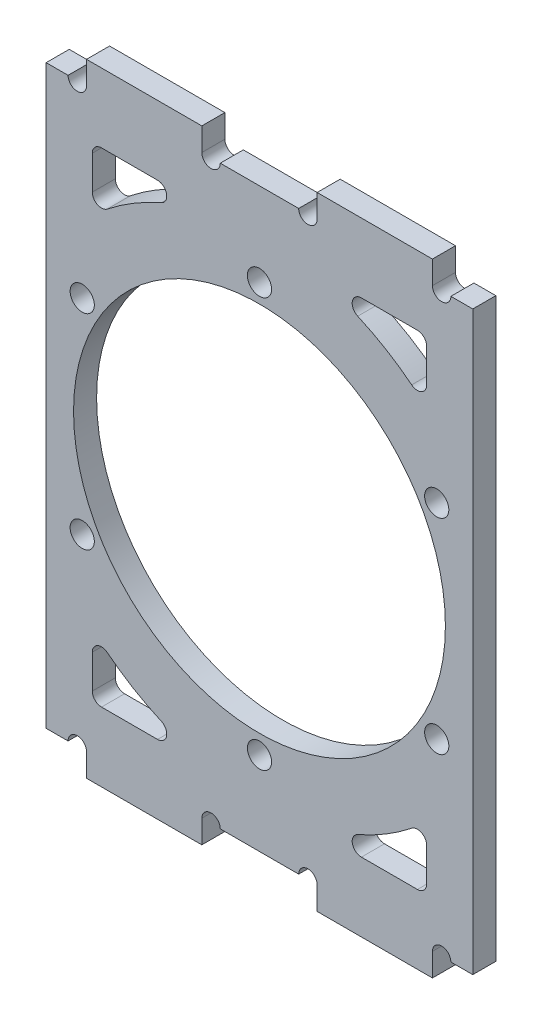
ISO-10303-21;
HEADER;
FILE_DESCRIPTION(('STEP AP214'),'2;1');
FILE_NAME('part.step','',(''),(''),'','','');
FILE_SCHEMA(('AUTOMOTIVE_DESIGN { 1 0 10303 214 1 1 1 1 }'));
ENDSEC;
DATA;
#1=APPLICATION_CONTEXT('core data for automotive mechanical design processes');
#2=APPLICATION_PROTOCOL_DEFINITION('international standard','automotive_design',2000,#1);
#3=PRODUCT_CONTEXT('',#1,'mechanical');
#4=PRODUCT('Part','Part','',(#3));
#5=PRODUCT_RELATED_PRODUCT_CATEGORY('part','',(#4));
#6=PRODUCT_DEFINITION_FORMATION('','',#4);
#7=PRODUCT_DEFINITION_CONTEXT('part definition',#1,'design');
#8=PRODUCT_DEFINITION('design','',#6,#7);
#9=PRODUCT_DEFINITION_SHAPE('','',#8);
#10=(LENGTH_UNIT() NAMED_UNIT(*) SI_UNIT(.MILLI.,.METRE.));
#11=(NAMED_UNIT(*) PLANE_ANGLE_UNIT() SI_UNIT($,.RADIAN.));
#12=(NAMED_UNIT(*) SI_UNIT($,.STERADIAN.) SOLID_ANGLE_UNIT());
#13=UNCERTAINTY_MEASURE_WITH_UNIT(LENGTH_MEASURE(1.E-05),#10,'distance_accuracy_value','');
#14=(GEOMETRIC_REPRESENTATION_CONTEXT(3) GLOBAL_UNCERTAINTY_ASSIGNED_CONTEXT((#13)) GLOBAL_UNIT_ASSIGNED_CONTEXT((#10,
#11,#12)) REPRESENTATION_CONTEXT('',''));
#15=CARTESIAN_POINT('',(0.,0.,0.));
#16=DIRECTION('',(0.,0.,1.));
#17=DIRECTION('',(1.,0.,0.));
#18=AXIS2_PLACEMENT_3D('',#15,#16,#17);
#19=CARTESIAN_POINT('',(-27.4,34.5550285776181,-6.));
#20=DIRECTION('',(0.,0.,1.));
#21=DIRECTION('',(1.,0.,0.));
#22=AXIS2_PLACEMENT_3D('',#19,#20,#21);
#23=CYLINDRICAL_SURFACE('',#22,1.6);
#24=CARTESIAN_POINT('',(-27.4,34.5550285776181,0.));
#25=DIRECTION('',(0.,0.,1.));
#26=DIRECTION('',(1.,0.,0.));
#27=AXIS2_PLACEMENT_3D('',#24,#25,#26);
#28=CIRCLE('',#27,1.6);
#29=CARTESIAN_POINT('',(-29.,34.5550285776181,0.));
#30=VERTEX_POINT('',#29);
#31=CARTESIAN_POINT('',(-26.4058956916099,33.3013313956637,0.));
#32=VERTEX_POINT('',#31);
#33=EDGE_CURVE('E786',#30,#32,#28,.T.);
#34=ORIENTED_EDGE('',*,*,#33,.F.);
#35=DIRECTION('',(0.,0.,-1.));
#36=VECTOR('',#35,1.);
#37=CARTESIAN_POINT('',(-29.,34.5550285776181,0.));
#38=LINE('',#37,#36);
#39=CARTESIAN_POINT('',(-29.,34.5550285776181,4.));
#40=VERTEX_POINT('',#39);
#41=EDGE_CURVE('E893',#40,#30,#38,.T.);
#42=ORIENTED_EDGE('',*,*,#41,.F.);
#43=CARTESIAN_POINT('',(-27.4,34.5550285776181,4.));
#44=DIRECTION('',(0.,0.,-1.));
#45=DIRECTION('',(1.,0.,0.));
#46=AXIS2_PLACEMENT_3D('',#43,#44,#45);
#47=CIRCLE('',#46,1.6);
#48=CARTESIAN_POINT('',(-26.4058956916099,33.3013313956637,4.));
#49=VERTEX_POINT('',#48);
#50=EDGE_CURVE('E617',#49,#40,#47,.T.);
#51=ORIENTED_EDGE('',*,*,#50,.F.);
#52=DIRECTION('',(0.,0.,1.));
#53=VECTOR('',#52,1.);
#54=CARTESIAN_POINT('',(-26.4058956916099,33.3013313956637,-6.));
#55=LINE('',#54,#53);
#56=EDGE_CURVE('E619',#32,#49,#55,.T.);
#57=ORIENTED_EDGE('',*,*,#56,.F.);
#58=EDGE_LOOP('',(#34,#42,#51,#57));
#59=FACE_BOUND('',#58,.T.);
#60=ADVANCED_FACE('F17',(#59),#23,.F.);
#61=CARTESIAN_POINT('',(17.6819116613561,40.4,-6.));
#62=DIRECTION('',(0.,0.,1.));
#63=DIRECTION('',(1.,0.,0.));
#64=AXIS2_PLACEMENT_3D('',#61,#62,#63);
#65=CYLINDRICAL_SURFACE('',#64,1.6);
#66=CARTESIAN_POINT('',(17.6819116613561,40.4,0.));
#67=DIRECTION('',(0.,0.,1.));
#68=DIRECTION('',(1.,0.,0.));
#69=AXIS2_PLACEMENT_3D('',#66,#67,#68);
#70=CIRCLE('',#69,1.6);
#71=CARTESIAN_POINT('',(17.6819116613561,42.,0.));
#72=VERTEX_POINT('',#71);
#73=CARTESIAN_POINT('',(17.0403910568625,38.9342403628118,0.));
#74=VERTEX_POINT('',#73);
#75=EDGE_CURVE('E798',#72,#74,#70,.T.);
#76=ORIENTED_EDGE('',*,*,#75,.F.);
#77=DIRECTION('',(0.,0.,-1.));
#78=VECTOR('',#77,1.);
#79=CARTESIAN_POINT('',(17.6819116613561,42.,-6.));
#80=LINE('',#79,#78);
#81=CARTESIAN_POINT('',(17.6819116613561,42.,4.));
#82=VERTEX_POINT('',#81);
#83=EDGE_CURVE('E903',#82,#72,#80,.T.);
#84=ORIENTED_EDGE('',*,*,#83,.F.);
#85=CARTESIAN_POINT('',(17.6819116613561,40.4,4.));
#86=DIRECTION('',(0.,0.,-1.));
#87=DIRECTION('',(1.,0.,0.));
#88=AXIS2_PLACEMENT_3D('',#85,#86,#87);
#89=CIRCLE('',#88,1.6);
#90=CARTESIAN_POINT('',(17.0403910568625,38.9342403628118,4.));
#91=VERTEX_POINT('',#90);
#92=EDGE_CURVE('E550',#91,#82,#89,.T.);
#93=ORIENTED_EDGE('',*,*,#92,.F.);
#94=DIRECTION('',(0.,0.,1.));
#95=VECTOR('',#94,1.);
#96=CARTESIAN_POINT('',(17.0403910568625,38.9342403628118,-6.));
#97=LINE('',#96,#95);
#98=EDGE_CURVE('E759',#74,#91,#97,.T.);
#99=ORIENTED_EDGE('',*,*,#98,.F.);
#100=EDGE_LOOP('',(#76,#84,#93,#99));
#101=FACE_BOUND('',#100,.T.);
#102=ADVANCED_FACE('F1224',(#101),#65,.F.);
#103=CARTESIAN_POINT('',(27.4,34.5550285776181,-6.));
#104=DIRECTION('',(0.,0.,1.));
#105=DIRECTION('',(1.,0.,0.));
#106=AXIS2_PLACEMENT_3D('',#103,#104,#105);
#107=CYLINDRICAL_SURFACE('',#106,1.6);
#108=CARTESIAN_POINT('',(27.4,34.5550285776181,0.));
#109=DIRECTION('',(0.,0.,1.));
#110=DIRECTION('',(1.,0.,0.));
#111=AXIS2_PLACEMENT_3D('',#108,#109,#110);
#112=CIRCLE('',#111,1.6);
#113=CARTESIAN_POINT('',(26.4058956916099,33.3013313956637,0.));
#114=VERTEX_POINT('',#113);
#115=CARTESIAN_POINT('',(29.,34.5550285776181,0.));
#116=VERTEX_POINT('',#115);
#117=EDGE_CURVE('E660',#114,#116,#112,.T.);
#118=ORIENTED_EDGE('',*,*,#117,.F.);
#119=DIRECTION('',(0.,0.,-1.));
#120=VECTOR('',#119,1.);
#121=CARTESIAN_POINT('',(26.4058956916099,33.3013313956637,-6.));
#122=LINE('',#121,#120);
#123=CARTESIAN_POINT('',(26.4058956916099,33.3013313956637,4.));
#124=VERTEX_POINT('',#123);
#125=EDGE_CURVE('E756',#124,#114,#122,.T.);
#126=ORIENTED_EDGE('',*,*,#125,.F.);
#127=CARTESIAN_POINT('',(27.4,34.5550285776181,4.));
#128=DIRECTION('',(0.,0.,-1.));
#129=DIRECTION('',(1.,0.,0.));
#130=AXIS2_PLACEMENT_3D('',#127,#128,#129);
#131=CIRCLE('',#130,1.6);
#132=CARTESIAN_POINT('',(29.,34.5550285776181,4.));
#133=VERTEX_POINT('',#132);
#134=EDGE_CURVE('E672',#133,#124,#131,.T.);
#135=ORIENTED_EDGE('',*,*,#134,.F.);
#136=DIRECTION('',(0.,0.,1.));
#137=VECTOR('',#136,1.);
#138=CARTESIAN_POINT('',(29.,34.5550285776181,-6.));
#139=LINE('',#138,#137);
#140=EDGE_CURVE('E913',#116,#133,#139,.T.);
#141=ORIENTED_EDGE('',*,*,#140,.F.);
#142=EDGE_LOOP('',(#118,#126,#135,#141));
#143=FACE_BOUND('',#142,.T.);
#144=ADVANCED_FACE('F19',(#143),#107,.F.);
#145=CARTESIAN_POINT('',(17.6819116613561,-40.4,-6.));
#146=DIRECTION('',(0.,0.,1.));
#147=DIRECTION('',(1.,0.,0.));
#148=AXIS2_PLACEMENT_3D('',#145,#146,#147);
#149=CYLINDRICAL_SURFACE('',#148,1.6);
#150=CARTESIAN_POINT('',(17.6819116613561,-40.4,0.));
#151=DIRECTION('',(0.,0.,1.));
#152=DIRECTION('',(1.,0.,0.));
#153=AXIS2_PLACEMENT_3D('',#150,#151,#152);
#154=CIRCLE('',#153,1.6);
#155=CARTESIAN_POINT('',(17.0403910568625,-38.9342403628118,0.));
#156=VERTEX_POINT('',#155);
#157=CARTESIAN_POINT('',(17.6819116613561,-42.,0.));
#158=VERTEX_POINT('',#157);
#159=EDGE_CURVE('E564',#156,#158,#154,.T.);
#160=ORIENTED_EDGE('',*,*,#159,.F.);
#161=DIRECTION('',(0.,0.,-1.));
#162=VECTOR('',#161,1.);
#163=CARTESIAN_POINT('',(17.0403910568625,-38.9342403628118,-6.));
#164=LINE('',#163,#162);
#165=CARTESIAN_POINT('',(17.0403910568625,-38.9342403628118,4.));
#166=VERTEX_POINT('',#165);
#167=EDGE_CURVE('E919',#166,#156,#164,.T.);
#168=ORIENTED_EDGE('',*,*,#167,.F.);
#169=CARTESIAN_POINT('',(17.6819116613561,-40.4,4.));
#170=DIRECTION('',(0.,0.,-1.));
#171=DIRECTION('',(1.,0.,0.));
#172=AXIS2_PLACEMENT_3D('',#169,#170,#171);
#173=CIRCLE('',#172,1.6);
#174=CARTESIAN_POINT('',(17.6819116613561,-42.,4.));
#175=VERTEX_POINT('',#174);
#176=EDGE_CURVE('E639',#175,#166,#173,.T.);
#177=ORIENTED_EDGE('',*,*,#176,.F.);
#178=DIRECTION('',(0.,0.,1.));
#179=VECTOR('',#178,1.);
#180=CARTESIAN_POINT('',(17.6819116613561,-42.,4.));
#181=LINE('',#180,#179);
#182=EDGE_CURVE('E907',#158,#175,#181,.T.);
#183=ORIENTED_EDGE('',*,*,#182,.F.);
#184=EDGE_LOOP('',(#160,#168,#177,#183));
#185=FACE_BOUND('',#184,.T.);
#186=ADVANCED_FACE('F1264',(#185),#149,.F.);
#187=CARTESIAN_POINT('',(-27.4,-34.5550285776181,-6.));
#188=DIRECTION('',(0.,0.,1.));
#189=DIRECTION('',(1.,0.,0.));
#190=AXIS2_PLACEMENT_3D('',#187,#188,#189);
#191=CYLINDRICAL_SURFACE('',#190,1.6);
#192=CARTESIAN_POINT('',(-27.4,-34.5550285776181,0.));
#193=DIRECTION('',(0.,0.,1.));
#194=DIRECTION('',(1.,0.,0.));
#195=AXIS2_PLACEMENT_3D('',#192,#193,#194);
#196=CIRCLE('',#195,1.6);
#197=CARTESIAN_POINT('',(-26.4058956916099,-33.3013313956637,0.));
#198=VERTEX_POINT('',#197);
#199=CARTESIAN_POINT('',(-29.,-34.5550285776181,0.));
#200=VERTEX_POINT('',#199);
#201=EDGE_CURVE('E803',#198,#200,#196,.T.);
#202=ORIENTED_EDGE('',*,*,#201,.F.);
#203=DIRECTION('',(0.,0.,-1.));
#204=VECTOR('',#203,1.);
#205=CARTESIAN_POINT('',(-26.4058956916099,-33.3013313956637,-6.));
#206=LINE('',#205,#204);
#207=CARTESIAN_POINT('',(-26.4058956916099,-33.3013313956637,4.));
#208=VERTEX_POINT('',#207);
#209=EDGE_CURVE('E904',#208,#198,#206,.T.);
#210=ORIENTED_EDGE('',*,*,#209,.F.);
#211=CARTESIAN_POINT('',(-27.4,-34.5550285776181,4.));
#212=DIRECTION('',(0.,0.,-1.));
#213=DIRECTION('',(1.,0.,0.));
#214=AXIS2_PLACEMENT_3D('',#211,#212,#213);
#215=CIRCLE('',#214,1.6);
#216=CARTESIAN_POINT('',(-29.,-34.5550285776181,4.));
#217=VERTEX_POINT('',#216);
#218=EDGE_CURVE('E708',#217,#208,#215,.T.);
#219=ORIENTED_EDGE('',*,*,#218,.F.);
#220=DIRECTION('',(0.,0.,1.));
#221=VECTOR('',#220,1.);
#222=CARTESIAN_POINT('',(-29.,-34.5550285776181,4.));
#223=LINE('',#222,#221);
#224=EDGE_CURVE('E11',#200,#217,#223,.T.);
#225=ORIENTED_EDGE('',*,*,#224,.F.);
#226=EDGE_LOOP('',(#202,#210,#219,#225));
#227=FACE_BOUND('',#226,.T.);
#228=ADVANCED_FACE('F952',(#227),#191,.F.);
#229=CARTESIAN_POINT('',(27.4,-34.5550285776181,-6.));
#230=DIRECTION('',(0.,0.,1.));
#231=DIRECTION('',(1.,0.,0.));
#232=AXIS2_PLACEMENT_3D('',#229,#230,#231);
#233=CYLINDRICAL_SURFACE('',#232,1.6);
#234=CARTESIAN_POINT('',(27.4,-34.5550285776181,0.));
#235=DIRECTION('',(0.,0.,1.));
#236=DIRECTION('',(1.,0.,0.));
#237=AXIS2_PLACEMENT_3D('',#234,#235,#236);
#238=CIRCLE('',#237,1.6);
#239=CARTESIAN_POINT('',(29.,-34.5550285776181,0.));
#240=VERTEX_POINT('',#239);
#241=CARTESIAN_POINT('',(26.40589569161,-33.3013313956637,0.));
#242=VERTEX_POINT('',#241);
#243=EDGE_CURVE('E766',#240,#242,#238,.T.);
#244=ORIENTED_EDGE('',*,*,#243,.F.);
#245=DIRECTION('',(0.,0.,-1.));
#246=VECTOR('',#245,1.);
#247=CARTESIAN_POINT('',(29.,-34.5550285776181,-6.));
#248=LINE('',#247,#246);
#249=CARTESIAN_POINT('',(29.,-34.5550285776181,4.));
#250=VERTEX_POINT('',#249);
#251=EDGE_CURVE('E925',#250,#240,#248,.T.);
#252=ORIENTED_EDGE('',*,*,#251,.F.);
#253=CARTESIAN_POINT('',(27.4,-34.5550285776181,4.));
#254=DIRECTION('',(0.,0.,-1.));
#255=DIRECTION('',(1.,0.,0.));
#256=AXIS2_PLACEMENT_3D('',#253,#254,#255);
#257=CIRCLE('',#256,1.6);
#258=CARTESIAN_POINT('',(26.40589569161,-33.3013313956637,4.));
#259=VERTEX_POINT('',#258);
#260=EDGE_CURVE('E635',#259,#250,#257,.T.);
#261=ORIENTED_EDGE('',*,*,#260,.F.);
#262=DIRECTION('',(0.,0.,1.));
#263=VECTOR('',#262,1.);
#264=CARTESIAN_POINT('',(26.40589569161,-33.3013313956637,-6.));
#265=LINE('',#264,#263);
#266=EDGE_CURVE('E916',#242,#259,#265,.T.);
#267=ORIENTED_EDGE('',*,*,#266,.F.);
#268=EDGE_LOOP('',(#244,#252,#261,#267));
#269=FACE_BOUND('',#268,.T.);
#270=ADVANCED_FACE('F1313',(#269),#233,.F.);
#271=CARTESIAN_POINT('',(27.4,-40.4,-6.));
#272=DIRECTION('',(0.,0.,1.));
#273=DIRECTION('',(1.,0.,0.));
#274=AXIS2_PLACEMENT_3D('',#271,#272,#273);
#275=CYLINDRICAL_SURFACE('',#274,1.6);
#276=CARTESIAN_POINT('',(27.4,-40.4,0.));
#277=DIRECTION('',(0.,0.,1.));
#278=DIRECTION('',(1.,0.,0.));
#279=AXIS2_PLACEMENT_3D('',#276,#277,#278);
#280=CIRCLE('',#279,1.6);
#281=CARTESIAN_POINT('',(27.4,-42.,0.));
#282=VERTEX_POINT('',#281);
#283=CARTESIAN_POINT('',(29.,-40.4,0.));
#284=VERTEX_POINT('',#283);
#285=EDGE_CURVE('E761',#282,#284,#280,.T.);
#286=ORIENTED_EDGE('',*,*,#285,.F.);
#287=DIRECTION('',(0.,0.,-1.));
#288=VECTOR('',#287,1.);
#289=CARTESIAN_POINT('',(27.4,-42.,-6.));
#290=LINE('',#289,#288);
#291=CARTESIAN_POINT('',(27.4,-42.,4.));
#292=VERTEX_POINT('',#291);
#293=EDGE_CURVE('E928',#292,#282,#290,.T.);
#294=ORIENTED_EDGE('',*,*,#293,.F.);
#295=CARTESIAN_POINT('',(27.4,-40.4,4.));
#296=DIRECTION('',(0.,0.,-1.));
#297=DIRECTION('',(1.,0.,0.));
#298=AXIS2_PLACEMENT_3D('',#295,#296,#297);
#299=CIRCLE('',#298,1.6);
#300=CARTESIAN_POINT('',(29.,-40.4,4.));
#301=VERTEX_POINT('',#300);
#302=EDGE_CURVE('E509',#301,#292,#299,.T.);
#303=ORIENTED_EDGE('',*,*,#302,.F.);
#304=DIRECTION('',(0.,0.,1.));
#305=VECTOR('',#304,1.);
#306=CARTESIAN_POINT('',(29.,-40.4,-6.));
#307=LINE('',#306,#305);
#308=EDGE_CURVE('E922',#284,#301,#307,.T.);
#309=ORIENTED_EDGE('',*,*,#308,.F.);
#310=EDGE_LOOP('',(#286,#294,#303,#309));
#311=FACE_BOUND('',#310,.T.);
#312=ADVANCED_FACE('F1310',(#311),#275,.F.);
#313=CARTESIAN_POINT('',(-27.4,-40.4,-6.));
#314=DIRECTION('',(0.,0.,-1.));
#315=DIRECTION('',(-1.,0.,0.));
#316=AXIS2_PLACEMENT_3D('',#313,#314,#315);
#317=CYLINDRICAL_SURFACE('',#316,1.6);
#318=CARTESIAN_POINT('',(-27.4,-40.4,0.));
#319=DIRECTION('',(0.,0.,1.));
#320=DIRECTION('',(1.,0.,0.));
#321=AXIS2_PLACEMENT_3D('',#318,#319,#320);
#322=CIRCLE('',#321,1.6);
#323=CARTESIAN_POINT('',(-29.,-40.4,0.));
#324=VERTEX_POINT('',#323);
#325=CARTESIAN_POINT('',(-27.4,-42.,0.));
#326=VERTEX_POINT('',#325);
#327=EDGE_CURVE('E811',#324,#326,#322,.T.);
#328=ORIENTED_EDGE('',*,*,#327,.F.);
#329=DIRECTION('',(0.,0.,-1.));
#330=VECTOR('',#329,1.);
#331=CARTESIAN_POINT('',(-29.,-40.4,0.));
#332=LINE('',#331,#330);
#333=CARTESIAN_POINT('',(-29.,-40.4,4.));
#334=VERTEX_POINT('',#333);
#335=EDGE_CURVE('E26',#334,#324,#332,.T.);
#336=ORIENTED_EDGE('',*,*,#335,.F.);
#337=CARTESIAN_POINT('',(-27.4,-40.4,4.));
#338=DIRECTION('',(0.,0.,-1.));
#339=DIRECTION('',(1.,0.,0.));
#340=AXIS2_PLACEMENT_3D('',#337,#338,#339);
#341=CIRCLE('',#340,1.6);
#342=CARTESIAN_POINT('',(-27.4,-42.,4.));
#343=VERTEX_POINT('',#342);
#344=EDGE_CURVE('E566',#343,#334,#341,.T.);
#345=ORIENTED_EDGE('',*,*,#344,.F.);
#346=DIRECTION('',(0.,0.,1.));
#347=VECTOR('',#346,1.);
#348=CARTESIAN_POINT('',(-27.4,-42.,4.));
#349=LINE('',#348,#347);
#350=EDGE_CURVE('E50',#326,#343,#349,.T.);
#351=ORIENTED_EDGE('',*,*,#350,.F.);
#352=EDGE_LOOP('',(#328,#336,#345,#351));
#353=FACE_BOUND('',#352,.T.);
#354=ADVANCED_FACE('F944',(#353),#317,.F.);
#355=CARTESIAN_POINT('',(27.4,40.4,-6.));
#356=DIRECTION('',(0.,0.,-1.));
#357=DIRECTION('',(-1.,0.,0.));
#358=AXIS2_PLACEMENT_3D('',#355,#356,#357);
#359=CYLINDRICAL_SURFACE('',#358,1.6);
#360=CARTESIAN_POINT('',(27.4,40.4,0.));
#361=DIRECTION('',(0.,0.,1.));
#362=DIRECTION('',(1.,0.,0.));
#363=AXIS2_PLACEMENT_3D('',#360,#361,#362);
#364=CIRCLE('',#363,1.6);
#365=CARTESIAN_POINT('',(29.,40.4,0.));
#366=VERTEX_POINT('',#365);
#367=CARTESIAN_POINT('',(27.4,42.,0.));
#368=VERTEX_POINT('',#367);
#369=EDGE_CURVE('E659',#366,#368,#364,.T.);
#370=ORIENTED_EDGE('',*,*,#369,.F.);
#371=DIRECTION('',(0.,0.,-1.));
#372=VECTOR('',#371,1.);
#373=CARTESIAN_POINT('',(29.,40.4,0.));
#374=LINE('',#373,#372);
#375=CARTESIAN_POINT('',(29.,40.4,4.));
#376=VERTEX_POINT('',#375);
#377=EDGE_CURVE('E910',#376,#366,#374,.T.);
#378=ORIENTED_EDGE('',*,*,#377,.F.);
#379=CARTESIAN_POINT('',(27.4,40.4,4.));
#380=DIRECTION('',(0.,0.,-1.));
#381=DIRECTION('',(1.,0.,0.));
#382=AXIS2_PLACEMENT_3D('',#379,#380,#381);
#383=CIRCLE('',#382,1.6);
#384=CARTESIAN_POINT('',(27.4,42.,4.));
#385=VERTEX_POINT('',#384);
#386=EDGE_CURVE('E549',#385,#376,#383,.T.);
#387=ORIENTED_EDGE('',*,*,#386,.F.);
#388=DIRECTION('',(0.,0.,1.));
#389=VECTOR('',#388,1.);
#390=CARTESIAN_POINT('',(27.4,42.,4.));
#391=LINE('',#390,#389);
#392=EDGE_CURVE('E900',#368,#385,#391,.T.);
#393=ORIENTED_EDGE('',*,*,#392,.F.);
#394=EDGE_LOOP('',(#370,#378,#387,#393));
#395=FACE_BOUND('',#394,.T.);
#396=ADVANCED_FACE('F1229',(#395),#359,.F.);
#397=CARTESIAN_POINT('',(-27.4,40.4,-6.));
#398=DIRECTION('',(0.,0.,1.));
#399=DIRECTION('',(1.,0.,0.));
#400=AXIS2_PLACEMENT_3D('',#397,#398,#399);
#401=CYLINDRICAL_SURFACE('',#400,1.6);
#402=CARTESIAN_POINT('',(-27.4,40.4,0.));
#403=DIRECTION('',(0.,0.,1.));
#404=DIRECTION('',(1.,0.,0.));
#405=AXIS2_PLACEMENT_3D('',#402,#403,#404);
#406=CIRCLE('',#405,1.6);
#407=CARTESIAN_POINT('',(-27.4,42.,0.));
#408=VERTEX_POINT('',#407);
#409=CARTESIAN_POINT('',(-29.,40.4,0.));
#410=VERTEX_POINT('',#409);
#411=EDGE_CURVE('E778',#408,#410,#406,.T.);
#412=ORIENTED_EDGE('',*,*,#411,.F.);
#413=DIRECTION('',(0.,0.,-1.));
#414=VECTOR('',#413,1.);
#415=CARTESIAN_POINT('',(-27.4,42.,-6.));
#416=LINE('',#415,#414);
#417=CARTESIAN_POINT('',(-27.4,42.,4.));
#418=VERTEX_POINT('',#417);
#419=EDGE_CURVE('E760',#418,#408,#416,.T.);
#420=ORIENTED_EDGE('',*,*,#419,.F.);
#421=CARTESIAN_POINT('',(-27.4,40.4,4.));
#422=DIRECTION('',(0.,0.,-1.));
#423=DIRECTION('',(1.,0.,0.));
#424=AXIS2_PLACEMENT_3D('',#421,#422,#423);
#425=CIRCLE('',#424,1.6);
#426=CARTESIAN_POINT('',(-29.,40.4,4.));
#427=VERTEX_POINT('',#426);
#428=EDGE_CURVE('E664',#427,#418,#425,.T.);
#429=ORIENTED_EDGE('',*,*,#428,.F.);
#430=DIRECTION('',(0.,0.,1.));
#431=VECTOR('',#430,1.);
#432=CARTESIAN_POINT('',(-29.,40.4,-6.));
#433=LINE('',#432,#431);
#434=EDGE_CURVE('E890',#410,#427,#433,.T.);
#435=ORIENTED_EDGE('',*,*,#434,.F.);
#436=EDGE_LOOP('',(#412,#420,#429,#435));
#437=FACE_BOUND('',#436,.T.);
#438=ADVANCED_FACE('F1398',(#437),#401,.F.);
#439=CARTESIAN_POINT('',(-29.,0.,-6.));
#440=DIRECTION('',(1.,0.,0.));
#441=DIRECTION('',(0.,1.,0.));
#442=AXIS2_PLACEMENT_3D('',#439,#440,#441);
#443=PLANE('',#442);
#444=DIRECTION('',(0.,1.,0.));
#445=VECTOR('',#444,1.);
#446=CARTESIAN_POINT('',(-29.,0.,4.));
#447=LINE('',#446,#445);
#448=EDGE_CURVE('E570',#334,#217,#447,.T.);
#449=ORIENTED_EDGE('',*,*,#448,.F.);
#450=ORIENTED_EDGE('',*,*,#335,.T.);
#451=DIRECTION('',(0.,1.,0.));
#452=VECTOR('',#451,1.);
#453=CARTESIAN_POINT('',(-29.,0.,0.));
#454=LINE('',#453,#452);
#455=EDGE_CURVE('E807',#324,#200,#454,.T.);
#456=ORIENTED_EDGE('',*,*,#455,.T.);
#457=ORIENTED_EDGE('',*,*,#224,.T.);
#458=EDGE_LOOP('',(#449,#450,#456,#457));
#459=FACE_BOUND('',#458,.T.);
#460=ADVANCED_FACE('F942',(#459),#443,.T.);
#461=CARTESIAN_POINT('',(0.,-42.,-6.));
#462=DIRECTION('',(0.,1.,0.));
#463=DIRECTION('',(1.,0.,0.));
#464=AXIS2_PLACEMENT_3D('',#461,#462,#463);
#465=PLANE('',#464);
#466=DIRECTION('',(-1.,0.,0.));
#467=VECTOR('',#466,1.);
#468=CARTESIAN_POINT('',(0.,-42.,0.));
#469=LINE('',#468,#467);
#470=CARTESIAN_POINT('',(-17.6819116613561,-42.,0.));
#471=VERTEX_POINT('',#470);
#472=EDGE_CURVE('E815',#471,#326,#469,.T.);
#473=ORIENTED_EDGE('',*,*,#472,.T.);
#474=ORIENTED_EDGE('',*,*,#350,.T.);
#475=DIRECTION('',(-1.,0.,0.));
#476=VECTOR('',#475,1.);
#477=CARTESIAN_POINT('',(0.,-42.,4.));
#478=LINE('',#477,#476);
#479=CARTESIAN_POINT('',(-17.6819116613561,-42.,4.));
#480=VERTEX_POINT('',#479);
#481=EDGE_CURVE('E571',#480,#343,#478,.T.);
#482=ORIENTED_EDGE('',*,*,#481,.F.);
#483=DIRECTION('',(0.,0.,-1.));
#484=VECTOR('',#483,1.);
#485=CARTESIAN_POINT('',(-17.6819116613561,-42.,0.));
#486=LINE('',#485,#484);
#487=EDGE_CURVE('E935',#480,#471,#486,.T.);
#488=ORIENTED_EDGE('',*,*,#487,.T.);
#489=EDGE_LOOP('',(#473,#474,#482,#488));
#490=FACE_BOUND('',#489,.T.);
#491=ADVANCED_FACE('F964',(#490),#465,.T.);
#492=CARTESIAN_POINT('',(0.,0.,-6.));
#493=DIRECTION('',(0.,0.,1.));
#494=DIRECTION('',(1.,0.,0.));
#495=AXIS2_PLACEMENT_3D('',#492,#493,#494);
#496=CYLINDRICAL_SURFACE('',#495,42.5);
#497=CARTESIAN_POINT('',(0.,0.,4.));
#498=DIRECTION('',(0.,0.,1.));
#499=DIRECTION('',(1.,0.,0.));
#500=AXIS2_PLACEMENT_3D('',#497,#498,#499);
#501=CIRCLE('',#500,42.5);
#502=CARTESIAN_POINT('',(-17.0403910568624,-38.9342403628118,4.));
#503=VERTEX_POINT('',#502);
#504=EDGE_CURVE('E645',#208,#503,#501,.T.);
#505=ORIENTED_EDGE('',*,*,#504,.F.);
#506=ORIENTED_EDGE('',*,*,#209,.T.);
#507=CARTESIAN_POINT('',(0.,0.,0.));
#508=DIRECTION('',(0.,0.,1.));
#509=DIRECTION('',(1.,0.,0.));
#510=AXIS2_PLACEMENT_3D('',#507,#508,#509);
#511=CIRCLE('',#510,42.5);
#512=CARTESIAN_POINT('',(-17.0403910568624,-38.9342403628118,0.));
#513=VERTEX_POINT('',#512);
#514=EDGE_CURVE('E802',#198,#513,#511,.T.);
#515=ORIENTED_EDGE('',*,*,#514,.T.);
#516=DIRECTION('',(0.,0.,1.));
#517=VECTOR('',#516,1.);
#518=CARTESIAN_POINT('',(-17.0403910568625,-38.9342403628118,-6.));
#519=LINE('',#518,#517);
#520=EDGE_CURVE('E972',#513,#503,#519,.T.);
#521=ORIENTED_EDGE('',*,*,#520,.T.);
#522=EDGE_LOOP('',(#505,#506,#515,#521));
#523=FACE_BOUND('',#522,.T.);
#524=ADVANCED_FACE('F1430',(#523),#496,.T.);
#525=CARTESIAN_POINT('',(0.,-42.,-6.));
#526=DIRECTION('',(0.,1.,0.));
#527=DIRECTION('',(1.,0.,0.));
#528=AXIS2_PLACEMENT_3D('',#525,#526,#527);
#529=PLANE('',#528);
#530=DIRECTION('',(-1.,0.,0.));
#531=VECTOR('',#530,1.);
#532=CARTESIAN_POINT('',(0.,-42.,4.));
#533=LINE('',#532,#531);
#534=EDGE_CURVE('E513',#292,#175,#533,.T.);
#535=ORIENTED_EDGE('',*,*,#534,.F.);
#536=ORIENTED_EDGE('',*,*,#293,.T.);
#537=DIRECTION('',(-1.,0.,0.));
#538=VECTOR('',#537,1.);
#539=CARTESIAN_POINT('',(0.,-42.,0.));
#540=LINE('',#539,#538);
#541=EDGE_CURVE('E720',#282,#158,#540,.T.);
#542=ORIENTED_EDGE('',*,*,#541,.T.);
#543=ORIENTED_EDGE('',*,*,#182,.T.);
#544=EDGE_LOOP('',(#535,#536,#542,#543));
#545=FACE_BOUND('',#544,.T.);
#546=ADVANCED_FACE('F1268',(#545),#529,.T.);
#547=CARTESIAN_POINT('',(29.,0.,-6.));
#548=DIRECTION('',(1.,0.,0.));
#549=DIRECTION('',(0.,1.,0.));
#550=AXIS2_PLACEMENT_3D('',#547,#548,#549);
#551=PLANE('',#550);
#552=DIRECTION('',(0.,1.,0.));
#553=VECTOR('',#552,1.);
#554=CARTESIAN_POINT('',(29.,0.,0.));
#555=LINE('',#554,#553);
#556=EDGE_CURVE('E765',#284,#240,#555,.T.);
#557=ORIENTED_EDGE('',*,*,#556,.F.);
#558=ORIENTED_EDGE('',*,*,#308,.T.);
#559=DIRECTION('',(0.,1.,0.));
#560=VECTOR('',#559,1.);
#561=CARTESIAN_POINT('',(29.,0.,4.));
#562=LINE('',#561,#560);
#563=EDGE_CURVE('E514',#301,#250,#562,.T.);
#564=ORIENTED_EDGE('',*,*,#563,.T.);
#565=ORIENTED_EDGE('',*,*,#251,.T.);
#566=EDGE_LOOP('',(#557,#558,#564,#565));
#567=FACE_BOUND('',#566,.T.);
#568=ADVANCED_FACE('F1363',(#567),#551,.F.);
#569=CARTESIAN_POINT('',(0.,0.,-6.));
#570=DIRECTION('',(0.,0.,1.));
#571=DIRECTION('',(1.,0.,0.));
#572=AXIS2_PLACEMENT_3D('',#569,#570,#571);
#573=CYLINDRICAL_SURFACE('',#572,42.5);
#574=CARTESIAN_POINT('',(0.,0.,0.));
#575=DIRECTION('',(0.,0.,1.));
#576=DIRECTION('',(1.,0.,0.));
#577=AXIS2_PLACEMENT_3D('',#574,#575,#576);
#578=CIRCLE('',#577,42.5);
#579=EDGE_CURVE('E560',#156,#242,#578,.T.);
#580=ORIENTED_EDGE('',*,*,#579,.T.);
#581=ORIENTED_EDGE('',*,*,#266,.T.);
#582=CARTESIAN_POINT('',(0.,0.,4.));
#583=DIRECTION('',(0.,0.,1.));
#584=DIRECTION('',(1.,0.,0.));
#585=AXIS2_PLACEMENT_3D('',#582,#583,#584);
#586=CIRCLE('',#585,42.5);
#587=EDGE_CURVE('E689',#166,#259,#586,.T.);
#588=ORIENTED_EDGE('',*,*,#587,.F.);
#589=ORIENTED_EDGE('',*,*,#167,.T.);
#590=EDGE_LOOP('',(#580,#581,#588,#589));
#591=FACE_BOUND('',#590,.T.);
#592=ADVANCED_FACE('F1259',(#591),#573,.T.);
#593=CARTESIAN_POINT('',(29.,0.,-6.));
#594=DIRECTION('',(1.,0.,0.));
#595=DIRECTION('',(0.,1.,0.));
#596=AXIS2_PLACEMENT_3D('',#593,#594,#595);
#597=PLANE('',#596);
#598=DIRECTION('',(0.,1.,0.));
#599=VECTOR('',#598,1.);
#600=CARTESIAN_POINT('',(29.,0.,4.));
#601=LINE('',#600,#599);
#602=EDGE_CURVE('E668',#133,#376,#601,.T.);
#603=ORIENTED_EDGE('',*,*,#602,.T.);
#604=ORIENTED_EDGE('',*,*,#377,.T.);
#605=DIRECTION('',(0.,1.,0.));
#606=VECTOR('',#605,1.);
#607=CARTESIAN_POINT('',(29.,0.,0.));
#608=LINE('',#607,#606);
#609=EDGE_CURVE('E655',#116,#366,#608,.T.);
#610=ORIENTED_EDGE('',*,*,#609,.F.);
#611=ORIENTED_EDGE('',*,*,#140,.T.);
#612=EDGE_LOOP('',(#603,#604,#610,#611));
#613=FACE_BOUND('',#612,.T.);
#614=ADVANCED_FACE('F1211',(#613),#597,.F.);
#615=CARTESIAN_POINT('',(0.,42.,-6.));
#616=DIRECTION('',(0.,1.,0.));
#617=DIRECTION('',(1.,0.,0.));
#618=AXIS2_PLACEMENT_3D('',#615,#616,#617);
#619=PLANE('',#618);
#620=DIRECTION('',(-1.,0.,0.));
#621=VECTOR('',#620,1.);
#622=CARTESIAN_POINT('',(0.,42.,0.));
#623=LINE('',#622,#621);
#624=EDGE_CURVE('E794',#368,#72,#623,.T.);
#625=ORIENTED_EDGE('',*,*,#624,.F.);
#626=ORIENTED_EDGE('',*,*,#392,.T.);
#627=DIRECTION('',(-1.,0.,0.));
#628=VECTOR('',#627,1.);
#629=CARTESIAN_POINT('',(0.,42.,4.));
#630=LINE('',#629,#628);
#631=EDGE_CURVE('E545',#385,#82,#630,.T.);
#632=ORIENTED_EDGE('',*,*,#631,.T.);
#633=ORIENTED_EDGE('',*,*,#83,.T.);
#634=EDGE_LOOP('',(#625,#626,#632,#633));
#635=FACE_BOUND('',#634,.T.);
#636=ADVANCED_FACE('F1227',(#635),#619,.F.);
#637=CARTESIAN_POINT('',(0.,0.,-6.));
#638=DIRECTION('',(0.,0.,1.));
#639=DIRECTION('',(1.,0.,0.));
#640=AXIS2_PLACEMENT_3D('',#637,#638,#639);
#641=CYLINDRICAL_SURFACE('',#640,42.5);
#642=CARTESIAN_POINT('',(0.,0.,4.));
#643=DIRECTION('',(0.,0.,1.));
#644=DIRECTION('',(1.,0.,0.));
#645=AXIS2_PLACEMENT_3D('',#642,#643,#644);
#646=CIRCLE('',#645,42.5);
#647=EDGE_CURVE('E676',#124,#91,#646,.T.);
#648=ORIENTED_EDGE('',*,*,#647,.F.);
#649=ORIENTED_EDGE('',*,*,#125,.T.);
#650=CARTESIAN_POINT('',(0.,0.,0.));
#651=DIRECTION('',(0.,0.,1.));
#652=DIRECTION('',(1.,0.,0.));
#653=AXIS2_PLACEMENT_3D('',#650,#651,#652);
#654=CIRCLE('',#653,42.5);
#655=EDGE_CURVE('E790',#114,#74,#654,.T.);
#656=ORIENTED_EDGE('',*,*,#655,.T.);
#657=ORIENTED_EDGE('',*,*,#98,.T.);
#658=EDGE_LOOP('',(#648,#649,#656,#657));
#659=FACE_BOUND('',#658,.T.);
#660=ADVANCED_FACE('F1220',(#659),#641,.T.);
#661=CARTESIAN_POINT('',(0.,42.,-6.));
#662=DIRECTION('',(0.,1.,0.));
#663=DIRECTION('',(1.,0.,0.));
#664=AXIS2_PLACEMENT_3D('',#661,#662,#663);
#665=PLANE('',#664);
#666=DIRECTION('',(-1.,0.,0.));
#667=VECTOR('',#666,1.);
#668=CARTESIAN_POINT('',(0.,42.,4.));
#669=LINE('',#668,#667);
#670=CARTESIAN_POINT('',(-17.6819116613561,42.,4.));
#671=VERTEX_POINT('',#670);
#672=EDGE_CURVE('E618',#671,#418,#669,.T.);
#673=ORIENTED_EDGE('',*,*,#672,.T.);
#674=ORIENTED_EDGE('',*,*,#419,.T.);
#675=DIRECTION('',(-1.,0.,0.));
#676=VECTOR('',#675,1.);
#677=CARTESIAN_POINT('',(0.,42.,0.));
#678=LINE('',#677,#676);
#679=CARTESIAN_POINT('',(-17.6819116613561,42.,0.));
#680=VERTEX_POINT('',#679);
#681=EDGE_CURVE('E774',#680,#408,#678,.T.);
#682=ORIENTED_EDGE('',*,*,#681,.F.);
#683=DIRECTION('',(0.,0.,1.));
#684=VECTOR('',#683,1.);
#685=CARTESIAN_POINT('',(-17.6819116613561,42.,-6.));
#686=LINE('',#685,#684);
#687=EDGE_CURVE('E966',#680,#671,#686,.T.);
#688=ORIENTED_EDGE('',*,*,#687,.T.);
#689=EDGE_LOOP('',(#673,#674,#682,#688));
#690=FACE_BOUND('',#689,.T.);
#691=ADVANCED_FACE('F1414',(#690),#665,.F.);
#692=CARTESIAN_POINT('',(-29.,0.,-6.));
#693=DIRECTION('',(1.,0.,0.));
#694=DIRECTION('',(0.,1.,0.));
#695=AXIS2_PLACEMENT_3D('',#692,#693,#694);
#696=PLANE('',#695);
#697=DIRECTION('',(0.,1.,0.));
#698=VECTOR('',#697,1.);
#699=CARTESIAN_POINT('',(-29.,0.,0.));
#700=LINE('',#699,#698);
#701=EDGE_CURVE('E782',#30,#410,#700,.T.);
#702=ORIENTED_EDGE('',*,*,#701,.T.);
#703=ORIENTED_EDGE('',*,*,#434,.T.);
#704=DIRECTION('',(0.,1.,0.));
#705=VECTOR('',#704,1.);
#706=CARTESIAN_POINT('',(-29.,0.,4.));
#707=LINE('',#706,#705);
#708=EDGE_CURVE('E654',#40,#427,#707,.T.);
#709=ORIENTED_EDGE('',*,*,#708,.F.);
#710=ORIENTED_EDGE('',*,*,#41,.T.);
#711=EDGE_LOOP('',(#702,#703,#709,#710));
#712=FACE_BOUND('',#711,.T.);
#713=ADVANCED_FACE('F1410',(#712),#696,.T.);
#714=CARTESIAN_POINT('',(0.,0.,-6.));
#715=DIRECTION('',(0.,0.,1.));
#716=DIRECTION('',(1.,0.,0.));
#717=AXIS2_PLACEMENT_3D('',#714,#715,#716);
#718=CYLINDRICAL_SURFACE('',#717,42.5);
#719=CARTESIAN_POINT('',(0.,0.,0.));
#720=DIRECTION('',(0.,0.,1.));
#721=DIRECTION('',(1.,0.,0.));
#722=AXIS2_PLACEMENT_3D('',#719,#720,#721);
#723=CIRCLE('',#722,42.5);
#724=CARTESIAN_POINT('',(-17.0403910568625,38.9342403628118,0.));
#725=VERTEX_POINT('',#724);
#726=EDGE_CURVE('E770',#725,#32,#723,.T.);
#727=ORIENTED_EDGE('',*,*,#726,.T.);
#728=ORIENTED_EDGE('',*,*,#56,.T.);
#729=CARTESIAN_POINT('',(0.,0.,4.));
#730=DIRECTION('',(0.,0.,1.));
#731=DIRECTION('',(1.,0.,0.));
#732=AXIS2_PLACEMENT_3D('',#729,#730,#731);
#733=CIRCLE('',#732,42.5);
#734=CARTESIAN_POINT('',(-17.0403910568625,38.9342403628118,4.));
#735=VERTEX_POINT('',#734);
#736=EDGE_CURVE('E613',#735,#49,#733,.T.);
#737=ORIENTED_EDGE('',*,*,#736,.F.);
#738=DIRECTION('',(0.,0.,-1.));
#739=VECTOR('',#738,1.);
#740=CARTESIAN_POINT('',(-17.0403910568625,38.9342403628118,-6.));
#741=LINE('',#740,#739);
#742=EDGE_CURVE('E622',#735,#725,#741,.T.);
#743=ORIENTED_EDGE('',*,*,#742,.T.);
#744=EDGE_LOOP('',(#727,#728,#737,#743));
#745=FACE_BOUND('',#744,.T.);
#746=ADVANCED_FACE('F1407',(#745),#718,.T.);
#747=CARTESIAN_POINT('',(-37.,0.,4.));
#748=DIRECTION('',(-1.,0.,0.));
#749=DIRECTION('',(0.,0.,1.));
#750=AXIS2_PLACEMENT_3D('',#747,#748,#749);
#751=PLANE('',#750);
#752=DIRECTION('',(0.,1.,0.));
#753=VECTOR('',#752,1.);
#754=CARTESIAN_POINT('',(-37.,0.,0.));
#755=LINE('',#754,#753);
#756=CARTESIAN_POINT('',(-37.,-50.,0.));
#757=VERTEX_POINT('',#756);
#758=CARTESIAN_POINT('',(-37.,50.,0.));
#759=VERTEX_POINT('',#758);
#760=EDGE_CURVE('E644',#757,#759,#755,.T.);
#761=ORIENTED_EDGE('',*,*,#760,.F.);
#762=DIRECTION('',(0.,0.,-1.));
#763=VECTOR('',#762,1.);
#764=CARTESIAN_POINT('',(-37.,-50.,4.));
#765=LINE('',#764,#763);
#766=CARTESIAN_POINT('',(-37.,-50.,4.));
#767=VERTEX_POINT('',#766);
#768=EDGE_CURVE('E821',#767,#757,#765,.T.);
#769=ORIENTED_EDGE('',*,*,#768,.F.);
#770=DIRECTION('',(0.,1.,0.));
#771=VECTOR('',#770,1.);
#772=CARTESIAN_POINT('',(-37.,0.,4.));
#773=LINE('',#772,#771);
#774=CARTESIAN_POINT('',(-37.,50.,4.));
#775=VERTEX_POINT('',#774);
#776=EDGE_CURVE('E631',#767,#775,#773,.T.);
#777=ORIENTED_EDGE('',*,*,#776,.T.);
#778=DIRECTION('',(0.,0.,-1.));
#779=VECTOR('',#778,1.);
#780=CARTESIAN_POINT('',(-37.,50.,4.));
#781=LINE('',#780,#779);
#782=EDGE_CURVE('E623',#775,#759,#781,.T.);
#783=ORIENTED_EDGE('',*,*,#782,.T.);
#784=EDGE_LOOP('',(#761,#769,#777,#783));
#785=FACE_BOUND('',#784,.T.);
#786=ADVANCED_FACE('F1192',(#785),#751,.T.);
#787=CARTESIAN_POINT('',(0.,50.,4.));
#788=DIRECTION('',(0.,-1.,0.));
#789=DIRECTION('',(0.,0.,-1.));
#790=AXIS2_PLACEMENT_3D('',#787,#788,#789);
#791=PLANE('',#790);
#792=DIRECTION('',(-1.,0.,0.));
#793=VECTOR('',#792,1.);
#794=CARTESIAN_POINT('',(0.,50.,0.));
#795=LINE('',#794,#793);
#796=CARTESIAN_POINT('',(-33.2,50.,0.));
#797=VERTEX_POINT('',#796);
#798=EDGE_CURVE('E716',#797,#759,#795,.T.);
#799=ORIENTED_EDGE('',*,*,#798,.T.);
#800=ORIENTED_EDGE('',*,*,#782,.F.);
#801=DIRECTION('',(-1.,0.,0.));
#802=VECTOR('',#801,1.);
#803=CARTESIAN_POINT('',(0.,50.,4.));
#804=LINE('',#803,#802);
#805=CARTESIAN_POINT('',(-33.2,50.,4.));
#806=VERTEX_POINT('',#805);
#807=EDGE_CURVE('E627',#806,#775,#804,.T.);
#808=ORIENTED_EDGE('',*,*,#807,.F.);
#809=DIRECTION('',(0.,0.,-1.));
#810=VECTOR('',#809,1.);
#811=CARTESIAN_POINT('',(-33.2,50.,4.));
#812=LINE('',#811,#810);
#813=EDGE_CURVE('E698',#806,#797,#812,.T.);
#814=ORIENTED_EDGE('',*,*,#813,.T.);
#815=EDGE_LOOP('',(#799,#800,#808,#814));
#816=FACE_BOUND('',#815,.T.);
#817=ADVANCED_FACE('F1188',(#816),#791,.F.);
#818=CARTESIAN_POINT('',(-31.6,50.,4.));
#819=DIRECTION('',(0.,0.,-1.));
#820=DIRECTION('',(-1.,0.,0.));
#821=AXIS2_PLACEMENT_3D('',#818,#819,#820);
#822=CYLINDRICAL_SURFACE('',#821,1.6);
#823=CARTESIAN_POINT('',(-31.6,50.,0.));
#824=DIRECTION('',(0.,0.,1.));
#825=DIRECTION('',(1.,0.,0.));
#826=AXIS2_PLACEMENT_3D('',#823,#824,#825);
#827=CIRCLE('',#826,1.6);
#828=CARTESIAN_POINT('',(-30.,50.,0.));
#829=VERTEX_POINT('',#828);
#830=EDGE_CURVE('E581',#797,#829,#827,.T.);
#831=ORIENTED_EDGE('',*,*,#830,.F.);
#832=ORIENTED_EDGE('',*,*,#813,.F.);
#833=CARTESIAN_POINT('',(-31.6,50.,4.));
#834=DIRECTION('',(0.,0.,1.));
#835=DIRECTION('',(1.,0.,0.));
#836=AXIS2_PLACEMENT_3D('',#833,#834,#835);
#837=CIRCLE('',#836,1.6);
#838=CARTESIAN_POINT('',(-30.,50.,4.));
#839=VERTEX_POINT('',#838);
#840=EDGE_CURVE('E612',#806,#839,#837,.T.);
#841=ORIENTED_EDGE('',*,*,#840,.T.);
#842=DIRECTION('',(0.,0.,-1.));
#843=VECTOR('',#842,1.);
#844=CARTESIAN_POINT('',(-30.,50.,4.));
#845=LINE('',#844,#843);
#846=EDGE_CURVE('E835',#839,#829,#845,.T.);
#847=ORIENTED_EDGE('',*,*,#846,.T.);
#848=EDGE_LOOP('',(#831,#832,#841,#847));
#849=FACE_BOUND('',#848,.T.);
#850=ADVANCED_FACE('F1183',(#849),#822,.F.);
#851=CARTESIAN_POINT('',(-30.,0.,4.));
#852=DIRECTION('',(-1.,0.,0.));
#853=DIRECTION('',(0.,0.,1.));
#854=AXIS2_PLACEMENT_3D('',#851,#852,#853);
#855=PLANE('',#854);
#856=DIRECTION('',(0.,1.,0.));
#857=VECTOR('',#856,1.);
#858=CARTESIAN_POINT('',(-30.,0.,0.));
#859=LINE('',#858,#857);
#860=CARTESIAN_POINT('',(-30.,54.,0.));
#861=VERTEX_POINT('',#860);
#862=EDGE_CURVE('E576',#829,#861,#859,.T.);
#863=ORIENTED_EDGE('',*,*,#862,.F.);
#864=ORIENTED_EDGE('',*,*,#846,.F.);
#865=DIRECTION('',(0.,1.,0.));
#866=VECTOR('',#865,1.);
#867=CARTESIAN_POINT('',(-30.,0.,4.));
#868=LINE('',#867,#866);
#869=CARTESIAN_POINT('',(-30.,54.,4.));
#870=VERTEX_POINT('',#869);
#871=EDGE_CURVE('E605',#839,#870,#868,.T.);
#872=ORIENTED_EDGE('',*,*,#871,.T.);
#873=DIRECTION('',(0.,0.,-1.));
#874=VECTOR('',#873,1.);
#875=CARTESIAN_POINT('',(-30.,54.,4.));
#876=LINE('',#875,#874);
#877=EDGE_CURVE('E884',#870,#861,#876,.T.);
#878=ORIENTED_EDGE('',*,*,#877,.T.);
#879=EDGE_LOOP('',(#863,#864,#872,#878));
#880=FACE_BOUND('',#879,.T.);
#881=ADVANCED_FACE('F1178',(#880),#855,.T.);
#882=CARTESIAN_POINT('',(0.,54.,4.));
#883=DIRECTION('',(0.,1.,0.));
#884=DIRECTION('',(1.,0.,0.));
#885=AXIS2_PLACEMENT_3D('',#882,#883,#884);
#886=PLANE('',#885);
#887=DIRECTION('',(1.,0.,0.));
#888=VECTOR('',#887,1.);
#889=CARTESIAN_POINT('',(0.,54.,0.));
#890=LINE('',#889,#888);
#891=CARTESIAN_POINT('',(-10.,54.,0.));
#892=VERTEX_POINT('',#891);
#893=EDGE_CURVE('E580',#861,#892,#890,.T.);
#894=ORIENTED_EDGE('',*,*,#893,.F.);
#895=ORIENTED_EDGE('',*,*,#877,.F.);
#896=DIRECTION('',(1.,0.,0.));
#897=VECTOR('',#896,1.);
#898=CARTESIAN_POINT('',(0.,54.,4.));
#899=LINE('',#898,#897);
#900=CARTESIAN_POINT('',(-10.,54.,4.));
#901=VERTEX_POINT('',#900);
#902=EDGE_CURVE('E555',#870,#901,#899,.T.);
#903=ORIENTED_EDGE('',*,*,#902,.T.);
#904=DIRECTION('',(0.,0.,-1.));
#905=VECTOR('',#904,1.);
#906=CARTESIAN_POINT('',(-10.,54.,4.));
#907=LINE('',#906,#905);
#908=EDGE_CURVE('E881',#901,#892,#907,.T.);
#909=ORIENTED_EDGE('',*,*,#908,.T.);
#910=EDGE_LOOP('',(#894,#895,#903,#909));
#911=FACE_BOUND('',#910,.T.);
#912=ADVANCED_FACE('F1175',(#911),#886,.T.);
#913=CARTESIAN_POINT('',(-10.,0.,4.));
#914=DIRECTION('',(-1.,0.,0.));
#915=DIRECTION('',(0.,0.,1.));
#916=AXIS2_PLACEMENT_3D('',#913,#914,#915);
#917=PLANE('',#916);
#918=DIRECTION('',(0.,1.,0.));
#919=VECTOR('',#918,1.);
#920=CARTESIAN_POINT('',(-10.,0.,0.));
#921=LINE('',#920,#919);
#922=CARTESIAN_POINT('',(-10.,50.,0.));
#923=VERTEX_POINT('',#922);
#924=EDGE_CURVE('E525',#923,#892,#921,.T.);
#925=ORIENTED_EDGE('',*,*,#924,.T.);
#926=ORIENTED_EDGE('',*,*,#908,.F.);
#927=DIRECTION('',(0.,1.,0.));
#928=VECTOR('',#927,1.);
#929=CARTESIAN_POINT('',(-10.,0.,4.));
#930=LINE('',#929,#928);
#931=CARTESIAN_POINT('',(-10.,50.,4.));
#932=VERTEX_POINT('',#931);
#933=EDGE_CURVE('E551',#932,#901,#930,.T.);
#934=ORIENTED_EDGE('',*,*,#933,.F.);
#935=DIRECTION('',(0.,0.,-1.));
#936=VECTOR('',#935,1.);
#937=CARTESIAN_POINT('',(-10.,50.,4.));
#938=LINE('',#937,#936);
#939=EDGE_CURVE('E878',#932,#923,#938,.T.);
#940=ORIENTED_EDGE('',*,*,#939,.T.);
#941=EDGE_LOOP('',(#925,#926,#934,#940));
#942=FACE_BOUND('',#941,.T.);
#943=ADVANCED_FACE('F1169',(#942),#917,.F.);
#944=CARTESIAN_POINT('',(-8.4,50.,4.));
#945=DIRECTION('',(0.,0.,-1.));
#946=DIRECTION('',(-1.,0.,0.));
#947=AXIS2_PLACEMENT_3D('',#944,#945,#946);
#948=CYLINDRICAL_SURFACE('',#947,1.6);
#949=CARTESIAN_POINT('',(-8.4,50.,0.));
#950=DIRECTION('',(0.,0.,1.));
#951=DIRECTION('',(1.,0.,0.));
#952=AXIS2_PLACEMENT_3D('',#949,#950,#951);
#953=CIRCLE('',#952,1.6);
#954=CARTESIAN_POINT('',(-6.8,50.,0.));
#955=VERTEX_POINT('',#954);
#956=EDGE_CURVE('E520',#923,#955,#953,.T.);
#957=ORIENTED_EDGE('',*,*,#956,.F.);
#958=ORIENTED_EDGE('',*,*,#939,.F.);
#959=CARTESIAN_POINT('',(-8.4,50.,4.));
#960=DIRECTION('',(0.,0.,1.));
#961=DIRECTION('',(1.,0.,0.));
#962=AXIS2_PLACEMENT_3D('',#959,#960,#961);
#963=CIRCLE('',#962,1.6);
#964=CARTESIAN_POINT('',(-6.8,50.,4.));
#965=VERTEX_POINT('',#964);
#966=EDGE_CURVE('E534',#932,#965,#963,.T.);
#967=ORIENTED_EDGE('',*,*,#966,.T.);
#968=DIRECTION('',(0.,0.,-1.));
#969=VECTOR('',#968,1.);
#970=CARTESIAN_POINT('',(-6.8,50.,4.));
#971=LINE('',#970,#969);
#972=EDGE_CURVE('E875',#965,#955,#971,.T.);
#973=ORIENTED_EDGE('',*,*,#972,.T.);
#974=EDGE_LOOP('',(#957,#958,#967,#973));
#975=FACE_BOUND('',#974,.T.);
#976=ADVANCED_FACE('F1164',(#975),#948,.F.);
#977=CARTESIAN_POINT('',(0.,50.,4.));
#978=DIRECTION('',(0.,-1.,0.));
#979=DIRECTION('',(0.,0.,-1.));
#980=AXIS2_PLACEMENT_3D('',#977,#978,#979);
#981=PLANE('',#980);
#982=DIRECTION('',(-1.,0.,0.));
#983=VECTOR('',#982,1.);
#984=CARTESIAN_POINT('',(0.,50.,0.));
#985=LINE('',#984,#983);
#986=CARTESIAN_POINT('',(6.8,50.,0.));
#987=VERTEX_POINT('',#986);
#988=EDGE_CURVE('E524',#987,#955,#985,.T.);
#989=ORIENTED_EDGE('',*,*,#988,.T.);
#990=ORIENTED_EDGE('',*,*,#972,.F.);
#991=DIRECTION('',(-1.,0.,0.));
#992=VECTOR('',#991,1.);
#993=CARTESIAN_POINT('',(0.,50.,4.));
#994=LINE('',#993,#992);
#995=CARTESIAN_POINT('',(6.8,50.,4.));
#996=VERTEX_POINT('',#995);
#997=EDGE_CURVE('E530',#996,#965,#994,.T.);
#998=ORIENTED_EDGE('',*,*,#997,.F.);
#999=DIRECTION('',(0.,0.,-1.));
#1000=VECTOR('',#999,1.);
#1001=CARTESIAN_POINT('',(6.8,50.,4.));
#1002=LINE('',#1001,#1000);
#1003=EDGE_CURVE('E872',#996,#987,#1002,.T.);
#1004=ORIENTED_EDGE('',*,*,#1003,.T.);
#1005=EDGE_LOOP('',(#989,#990,#998,#1004));
#1006=FACE_BOUND('',#1005,.T.);
#1007=ADVANCED_FACE('F1160',(#1006),#981,.F.);
#1008=CARTESIAN_POINT('',(8.4,50.,4.));
#1009=DIRECTION('',(0.,0.,-1.));
#1010=DIRECTION('',(-1.,0.,0.));
#1011=AXIS2_PLACEMENT_3D('',#1008,#1009,#1010);
#1012=CYLINDRICAL_SURFACE('',#1011,1.6);
#1013=CARTESIAN_POINT('',(8.4,50.,0.));
#1014=DIRECTION('',(0.,0.,-1.));
#1015=DIRECTION('',(1.,0.,0.));
#1016=AXIS2_PLACEMENT_3D('',#1013,#1014,#1015);
#1017=CIRCLE('',#1016,1.6);
#1018=CARTESIAN_POINT('',(10.,50.,0.));
#1019=VERTEX_POINT('',#1018);
#1020=EDGE_CURVE('E540',#1019,#987,#1017,.T.);
#1021=ORIENTED_EDGE('',*,*,#1020,.T.);
#1022=ORIENTED_EDGE('',*,*,#1003,.F.);
#1023=CARTESIAN_POINT('',(8.4,50.,4.));
#1024=DIRECTION('',(0.,0.,-1.));
#1025=DIRECTION('',(1.,0.,0.));
#1026=AXIS2_PLACEMENT_3D('',#1023,#1024,#1025);
#1027=CIRCLE('',#1026,1.6);
#1028=CARTESIAN_POINT('',(10.,50.,4.));
#1029=VERTEX_POINT('',#1028);
#1030=EDGE_CURVE('E535',#1029,#996,#1027,.T.);
#1031=ORIENTED_EDGE('',*,*,#1030,.F.);
#1032=DIRECTION('',(0.,0.,-1.));
#1033=VECTOR('',#1032,1.);
#1034=CARTESIAN_POINT('',(10.,50.,4.));
#1035=LINE('',#1034,#1033);
#1036=EDGE_CURVE('E869',#1029,#1019,#1035,.T.);
#1037=ORIENTED_EDGE('',*,*,#1036,.T.);
#1038=EDGE_LOOP('',(#1021,#1022,#1031,#1037));
#1039=FACE_BOUND('',#1038,.T.);
#1040=ADVANCED_FACE('F1156',(#1039),#1012,.F.);
#1041=CARTESIAN_POINT('',(10.,0.,4.));
#1042=DIRECTION('',(-1.,0.,0.));
#1043=DIRECTION('',(0.,0.,1.));
#1044=AXIS2_PLACEMENT_3D('',#1041,#1042,#1043);
#1045=PLANE('',#1044);
#1046=DIRECTION('',(0.,1.,0.));
#1047=VECTOR('',#1046,1.);
#1048=CARTESIAN_POINT('',(10.,0.,0.));
#1049=LINE('',#1048,#1047);
#1050=CARTESIAN_POINT('',(10.,54.,0.));
#1051=VERTEX_POINT('',#1050);
#1052=EDGE_CURVE('E544',#1019,#1051,#1049,.T.);
#1053=ORIENTED_EDGE('',*,*,#1052,.F.);
#1054=ORIENTED_EDGE('',*,*,#1036,.F.);
#1055=DIRECTION('',(0.,1.,0.));
#1056=VECTOR('',#1055,1.);
#1057=CARTESIAN_POINT('',(10.,0.,4.));
#1058=LINE('',#1057,#1056);
#1059=CARTESIAN_POINT('',(10.,54.,4.));
#1060=VERTEX_POINT('',#1059);
#1061=EDGE_CURVE('E586',#1029,#1060,#1058,.T.);
#1062=ORIENTED_EDGE('',*,*,#1061,.T.);
#1063=DIRECTION('',(0.,0.,-1.));
#1064=VECTOR('',#1063,1.);
#1065=CARTESIAN_POINT('',(10.,54.,4.));
#1066=LINE('',#1065,#1064);
#1067=EDGE_CURVE('E868',#1060,#1051,#1066,.T.);
#1068=ORIENTED_EDGE('',*,*,#1067,.T.);
#1069=EDGE_LOOP('',(#1053,#1054,#1062,#1068));
#1070=FACE_BOUND('',#1069,.T.);
#1071=ADVANCED_FACE('F1152',(#1070),#1045,.T.);
#1072=CARTESIAN_POINT('',(0.,54.,4.));
#1073=DIRECTION('',(0.,-1.,0.));
#1074=DIRECTION('',(0.,0.,-1.));
#1075=AXIS2_PLACEMENT_3D('',#1072,#1073,#1074);
#1076=PLANE('',#1075);
#1077=DIRECTION('',(-1.,0.,0.));
#1078=VECTOR('',#1077,1.);
#1079=CARTESIAN_POINT('',(0.,54.,0.));
#1080=LINE('',#1079,#1078);
#1081=CARTESIAN_POINT('',(30.,54.,0.));
#1082=VERTEX_POINT('',#1081);
#1083=EDGE_CURVE('E646',#1082,#1051,#1080,.T.);
#1084=ORIENTED_EDGE('',*,*,#1083,.T.);
#1085=ORIENTED_EDGE('',*,*,#1067,.F.);
#1086=DIRECTION('',(-1.,0.,0.));
#1087=VECTOR('',#1086,1.);
#1088=CARTESIAN_POINT('',(0.,54.,4.));
#1089=LINE('',#1088,#1087);
#1090=CARTESIAN_POINT('',(30.,54.,4.));
#1091=VERTEX_POINT('',#1090);
#1092=EDGE_CURVE('E585',#1091,#1060,#1089,.T.);
#1093=ORIENTED_EDGE('',*,*,#1092,.F.);
#1094=DIRECTION('',(0.,0.,-1.));
#1095=VECTOR('',#1094,1.);
#1096=CARTESIAN_POINT('',(30.,54.,4.));
#1097=LINE('',#1096,#1095);
#1098=EDGE_CURVE('E865',#1091,#1082,#1097,.T.);
#1099=ORIENTED_EDGE('',*,*,#1098,.T.);
#1100=EDGE_LOOP('',(#1084,#1085,#1093,#1099));
#1101=FACE_BOUND('',#1100,.T.);
#1102=ADVANCED_FACE('F1148',(#1101),#1076,.F.);
#1103=CARTESIAN_POINT('',(30.,0.,4.));
#1104=DIRECTION('',(-1.,0.,0.));
#1105=DIRECTION('',(0.,0.,1.));
#1106=AXIS2_PLACEMENT_3D('',#1103,#1104,#1105);
#1107=PLANE('',#1106);
#1108=DIRECTION('',(0.,1.,0.));
#1109=VECTOR('',#1108,1.);
#1110=CARTESIAN_POINT('',(30.,0.,0.));
#1111=LINE('',#1110,#1109);
#1112=CARTESIAN_POINT('',(30.,50.,0.));
#1113=VERTEX_POINT('',#1112);
#1114=EDGE_CURVE('E650',#1113,#1082,#1111,.T.);
#1115=ORIENTED_EDGE('',*,*,#1114,.T.);
#1116=ORIENTED_EDGE('',*,*,#1098,.F.);
#1117=DIRECTION('',(0.,1.,0.));
#1118=VECTOR('',#1117,1.);
#1119=CARTESIAN_POINT('',(30.,0.,4.));
#1120=LINE('',#1119,#1118);
#1121=CARTESIAN_POINT('',(30.,50.,4.));
#1122=VERTEX_POINT('',#1121);
#1123=EDGE_CURVE('E575',#1122,#1091,#1120,.T.);
#1124=ORIENTED_EDGE('',*,*,#1123,.F.);
#1125=DIRECTION('',(0.,0.,-1.));
#1126=VECTOR('',#1125,1.);
#1127=CARTESIAN_POINT('',(30.,50.,4.));
#1128=LINE('',#1127,#1126);
#1129=EDGE_CURVE('E862',#1122,#1113,#1128,.T.);
#1130=ORIENTED_EDGE('',*,*,#1129,.T.);
#1131=EDGE_LOOP('',(#1115,#1116,#1124,#1130));
#1132=FACE_BOUND('',#1131,.T.);
#1133=ADVANCED_FACE('F1144',(#1132),#1107,.F.);
#1134=CARTESIAN_POINT('',(31.6,50.,4.));
#1135=DIRECTION('',(0.,0.,-1.));
#1136=DIRECTION('',(-1.,0.,0.));
#1137=AXIS2_PLACEMENT_3D('',#1134,#1135,#1136);
#1138=CYLINDRICAL_SURFACE('',#1137,1.6);
#1139=CARTESIAN_POINT('',(31.6,50.,0.));
#1140=DIRECTION('',(0.,0.,-1.));
#1141=DIRECTION('',(1.,0.,0.));
#1142=AXIS2_PLACEMENT_3D('',#1139,#1140,#1141);
#1143=CIRCLE('',#1142,1.6);
#1144=CARTESIAN_POINT('',(33.2,50.,0.));
#1145=VERTEX_POINT('',#1144);
#1146=EDGE_CURVE('E712',#1145,#1113,#1143,.T.);
#1147=ORIENTED_EDGE('',*,*,#1146,.T.);
#1148=ORIENTED_EDGE('',*,*,#1129,.F.);
#1149=CARTESIAN_POINT('',(31.6,50.,4.));
#1150=DIRECTION('',(0.,0.,-1.));
#1151=DIRECTION('',(1.,0.,0.));
#1152=AXIS2_PLACEMENT_3D('',#1149,#1150,#1151);
#1153=CIRCLE('',#1152,1.6);
#1154=CARTESIAN_POINT('',(33.2,50.,4.));
#1155=VERTEX_POINT('',#1154);
#1156=EDGE_CURVE('E559',#1155,#1122,#1153,.T.);
#1157=ORIENTED_EDGE('',*,*,#1156,.F.);
#1158=DIRECTION('',(0.,0.,-1.));
#1159=VECTOR('',#1158,1.);
#1160=CARTESIAN_POINT('',(33.2,50.,4.));
#1161=LINE('',#1160,#1159);
#1162=EDGE_CURVE('E859',#1155,#1145,#1161,.T.);
#1163=ORIENTED_EDGE('',*,*,#1162,.T.);
#1164=EDGE_LOOP('',(#1147,#1148,#1157,#1163));
#1165=FACE_BOUND('',#1164,.T.);
#1166=ADVANCED_FACE('F1140',(#1165),#1138,.F.);
#1167=CARTESIAN_POINT('',(0.,50.,4.));
#1168=DIRECTION('',(0.,-1.,0.));
#1169=DIRECTION('',(0.,0.,-1.));
#1170=AXIS2_PLACEMENT_3D('',#1167,#1168,#1169);
#1171=PLANE('',#1170);
#1172=DIRECTION('',(-1.,0.,0.));
#1173=VECTOR('',#1172,1.);
#1174=CARTESIAN_POINT('',(0.,50.,0.));
#1175=LINE('',#1174,#1173);
#1176=CARTESIAN_POINT('',(37.,50.,0.));
#1177=VERTEX_POINT('',#1176);
#1178=EDGE_CURVE('E695',#1177,#1145,#1175,.T.);
#1179=ORIENTED_EDGE('',*,*,#1178,.T.);
#1180=ORIENTED_EDGE('',*,*,#1162,.F.);
#1181=DIRECTION('',(-1.,0.,0.));
#1182=VECTOR('',#1181,1.);
#1183=CARTESIAN_POINT('',(0.,50.,4.));
#1184=LINE('',#1183,#1182);
#1185=CARTESIAN_POINT('',(37.,50.,4.));
#1186=VERTEX_POINT('',#1185);
#1187=EDGE_CURVE('E539',#1186,#1155,#1184,.T.);
#1188=ORIENTED_EDGE('',*,*,#1187,.F.);
#1189=DIRECTION('',(0.,0.,-1.));
#1190=VECTOR('',#1189,1.);
#1191=CARTESIAN_POINT('',(37.,50.,4.));
#1192=LINE('',#1191,#1190);
#1193=EDGE_CURVE('E856',#1186,#1177,#1192,.T.);
#1194=ORIENTED_EDGE('',*,*,#1193,.T.);
#1195=EDGE_LOOP('',(#1179,#1180,#1188,#1194));
#1196=FACE_BOUND('',#1195,.T.);
#1197=ADVANCED_FACE('F1136',(#1196),#1171,.F.);
#1198=CARTESIAN_POINT('',(37.,0.,4.));
#1199=DIRECTION('',(-1.,0.,0.));
#1200=DIRECTION('',(0.,0.,1.));
#1201=AXIS2_PLACEMENT_3D('',#1198,#1199,#1200);
#1202=PLANE('',#1201);
#1203=DIRECTION('',(0.,1.,0.));
#1204=VECTOR('',#1203,1.);
#1205=CARTESIAN_POINT('',(37.,0.,0.));
#1206=LINE('',#1205,#1204);
#1207=CARTESIAN_POINT('',(37.,-50.,0.));
#1208=VERTEX_POINT('',#1207);
#1209=EDGE_CURVE('E690',#1208,#1177,#1206,.T.);
#1210=ORIENTED_EDGE('',*,*,#1209,.T.);
#1211=ORIENTED_EDGE('',*,*,#1193,.F.);
#1212=DIRECTION('',(0.,1.,0.));
#1213=VECTOR('',#1212,1.);
#1214=CARTESIAN_POINT('',(37.,0.,4.));
#1215=LINE('',#1214,#1213);
#1216=CARTESIAN_POINT('',(37.,-50.,4.));
#1217=VERTEX_POINT('',#1216);
#1218=EDGE_CURVE('E529',#1217,#1186,#1215,.T.);
#1219=ORIENTED_EDGE('',*,*,#1218,.F.);
#1220=DIRECTION('',(0.,0.,-1.));
#1221=VECTOR('',#1220,1.);
#1222=CARTESIAN_POINT('',(37.,-50.,4.));
#1223=LINE('',#1222,#1221);
#1224=EDGE_CURVE('E848',#1217,#1208,#1223,.T.);
#1225=ORIENTED_EDGE('',*,*,#1224,.T.);
#1226=EDGE_LOOP('',(#1210,#1211,#1219,#1225));
#1227=FACE_BOUND('',#1226,.T.);
#1228=ADVANCED_FACE('F1132',(#1227),#1202,.F.);
#1229=CARTESIAN_POINT('',(0.,-50.,4.));
#1230=DIRECTION('',(0.,-1.,0.));
#1231=DIRECTION('',(0.,0.,-1.));
#1232=AXIS2_PLACEMENT_3D('',#1229,#1230,#1231);
#1233=PLANE('',#1232);
#1234=DIRECTION('',(-1.,0.,0.));
#1235=VECTOR('',#1234,1.);
#1236=CARTESIAN_POINT('',(0.,-50.,0.));
#1237=LINE('',#1236,#1235);
#1238=CARTESIAN_POINT('',(33.2,-50.,0.));
#1239=VERTEX_POINT('',#1238);
#1240=EDGE_CURVE('E694',#1208,#1239,#1237,.T.);
#1241=ORIENTED_EDGE('',*,*,#1240,.F.);
#1242=ORIENTED_EDGE('',*,*,#1224,.F.);
#1243=DIRECTION('',(-1.,0.,0.));
#1244=VECTOR('',#1243,1.);
#1245=CARTESIAN_POINT('',(0.,-50.,4.));
#1246=LINE('',#1245,#1244);
#1247=CARTESIAN_POINT('',(33.2,-50.,4.));
#1248=VERTEX_POINT('',#1247);
#1249=EDGE_CURVE('E519',#1217,#1248,#1246,.T.);
#1250=ORIENTED_EDGE('',*,*,#1249,.T.);
#1251=DIRECTION('',(0.,0.,-1.));
#1252=VECTOR('',#1251,1.);
#1253=CARTESIAN_POINT('',(33.2,-50.,4.));
#1254=LINE('',#1253,#1252);
#1255=EDGE_CURVE('E845',#1248,#1239,#1254,.T.);
#1256=ORIENTED_EDGE('',*,*,#1255,.T.);
#1257=EDGE_LOOP('',(#1241,#1242,#1250,#1256));
#1258=FACE_BOUND('',#1257,.T.);
#1259=ADVANCED_FACE('F1128',(#1258),#1233,.T.);
#1260=CARTESIAN_POINT('',(31.6,-50.,4.));
#1261=DIRECTION('',(0.,0.,-1.));
#1262=DIRECTION('',(-1.,0.,0.));
#1263=AXIS2_PLACEMENT_3D('',#1260,#1261,#1262);
#1264=CYLINDRICAL_SURFACE('',#1263,1.6);
#1265=CARTESIAN_POINT('',(31.6,-50.,0.));
#1266=DIRECTION('',(0.,0.,1.));
#1267=DIRECTION('',(1.,0.,0.));
#1268=AXIS2_PLACEMENT_3D('',#1265,#1266,#1267);
#1269=CIRCLE('',#1268,1.6);
#1270=CARTESIAN_POINT('',(30.,-50.,0.));
#1271=VERTEX_POINT('',#1270);
#1272=EDGE_CURVE('E601',#1239,#1271,#1269,.T.);
#1273=ORIENTED_EDGE('',*,*,#1272,.F.);
#1274=ORIENTED_EDGE('',*,*,#1255,.F.);
#1275=CARTESIAN_POINT('',(31.6,-50.,4.));
#1276=DIRECTION('',(0.,0.,1.));
#1277=DIRECTION('',(1.,0.,0.));
#1278=AXIS2_PLACEMENT_3D('',#1275,#1276,#1277);
#1279=CIRCLE('',#1278,1.6);
#1280=CARTESIAN_POINT('',(30.,-50.,4.));
#1281=VERTEX_POINT('',#1280);
#1282=EDGE_CURVE('E515',#1248,#1281,#1279,.T.);
#1283=ORIENTED_EDGE('',*,*,#1282,.T.);
#1284=DIRECTION('',(0.,0.,-1.));
#1285=VECTOR('',#1284,1.);
#1286=CARTESIAN_POINT('',(30.,-50.,4.));
#1287=LINE('',#1286,#1285);
#1288=EDGE_CURVE('E849',#1281,#1271,#1287,.T.);
#1289=ORIENTED_EDGE('',*,*,#1288,.T.);
#1290=EDGE_LOOP('',(#1273,#1274,#1283,#1289));
#1291=FACE_BOUND('',#1290,.T.);
#1292=ADVANCED_FACE('F1125',(#1291),#1264,.F.);
#1293=CARTESIAN_POINT('',(30.,0.,4.));
#1294=DIRECTION('',(1.,0.,0.));
#1295=DIRECTION('',(0.,1.,0.));
#1296=AXIS2_PLACEMENT_3D('',#1293,#1294,#1295);
#1297=PLANE('',#1296);
#1298=DIRECTION('',(0.,-1.,0.));
#1299=VECTOR('',#1298,1.);
#1300=CARTESIAN_POINT('',(30.,0.,0.));
#1301=LINE('',#1300,#1299);
#1302=CARTESIAN_POINT('',(30.,-54.,0.));
#1303=VERTEX_POINT('',#1302);
#1304=EDGE_CURVE('E596',#1271,#1303,#1301,.T.);
#1305=ORIENTED_EDGE('',*,*,#1304,.F.);
#1306=ORIENTED_EDGE('',*,*,#1288,.F.);
#1307=DIRECTION('',(0.,-1.,0.));
#1308=VECTOR('',#1307,1.);
#1309=CARTESIAN_POINT('',(30.,0.,4.));
#1310=LINE('',#1309,#1308);
#1311=CARTESIAN_POINT('',(30.,-54.,4.));
#1312=VERTEX_POINT('',#1311);
#1313=EDGE_CURVE('E508',#1281,#1312,#1310,.T.);
#1314=ORIENTED_EDGE('',*,*,#1313,.T.);
#1315=DIRECTION('',(0.,0.,-1.));
#1316=VECTOR('',#1315,1.);
#1317=CARTESIAN_POINT('',(30.,-54.,4.));
#1318=LINE('',#1317,#1316);
#1319=EDGE_CURVE('E841',#1312,#1303,#1318,.T.);
#1320=ORIENTED_EDGE('',*,*,#1319,.T.);
#1321=EDGE_LOOP('',(#1305,#1306,#1314,#1320));
#1322=FACE_BOUND('',#1321,.T.);
#1323=ADVANCED_FACE('F1120',(#1322),#1297,.T.);
#1324=CARTESIAN_POINT('',(0.,-54.,4.));
#1325=DIRECTION('',(0.,-1.,0.));
#1326=DIRECTION('',(-1.,0.,0.));
#1327=AXIS2_PLACEMENT_3D('',#1324,#1325,#1326);
#1328=PLANE('',#1327);
#1329=DIRECTION('',(-1.,0.,0.));
#1330=VECTOR('',#1329,1.);
#1331=CARTESIAN_POINT('',(0.,-54.,0.));
#1332=LINE('',#1331,#1330);
#1333=CARTESIAN_POINT('',(10.,-54.,0.));
#1334=VERTEX_POINT('',#1333);
#1335=EDGE_CURVE('E600',#1303,#1334,#1332,.T.);
#1336=ORIENTED_EDGE('',*,*,#1335,.F.);
#1337=ORIENTED_EDGE('',*,*,#1319,.F.);
#1338=DIRECTION('',(-1.,0.,0.));
#1339=VECTOR('',#1338,1.);
#1340=CARTESIAN_POINT('',(0.,-54.,4.));
#1341=LINE('',#1340,#1339);
#1342=CARTESIAN_POINT('',(10.,-54.,4.));
#1343=VERTEX_POINT('',#1342);
#1344=EDGE_CURVE('E504',#1312,#1343,#1341,.T.);
#1345=ORIENTED_EDGE('',*,*,#1344,.T.);
#1346=DIRECTION('',(0.,0.,-1.));
#1347=VECTOR('',#1346,1.);
#1348=CARTESIAN_POINT('',(10.,-54.,4.));
#1349=LINE('',#1348,#1347);
#1350=EDGE_CURVE('E838',#1343,#1334,#1349,.T.);
#1351=ORIENTED_EDGE('',*,*,#1350,.T.);
#1352=EDGE_LOOP('',(#1336,#1337,#1345,#1351));
#1353=FACE_BOUND('',#1352,.T.);
#1354=ADVANCED_FACE('F1115',(#1353),#1328,.T.);
#1355=CARTESIAN_POINT('',(10.,0.,4.));
#1356=DIRECTION('',(1.,0.,0.));
#1357=DIRECTION('',(0.,1.,0.));
#1358=AXIS2_PLACEMENT_3D('',#1355,#1356,#1357);
#1359=PLANE('',#1358);
#1360=DIRECTION('',(0.,-1.,0.));
#1361=VECTOR('',#1360,1.);
#1362=CARTESIAN_POINT('',(10.,0.,0.));
#1363=LINE('',#1362,#1361);
#1364=CARTESIAN_POINT('',(10.,-50.,0.));
#1365=VERTEX_POINT('',#1364);
#1366=EDGE_CURVE('E733',#1365,#1334,#1363,.T.);
#1367=ORIENTED_EDGE('',*,*,#1366,.T.);
#1368=ORIENTED_EDGE('',*,*,#1350,.F.);
#1369=DIRECTION('',(0.,-1.,0.));
#1370=VECTOR('',#1369,1.);
#1371=CARTESIAN_POINT('',(10.,0.,4.));
#1372=LINE('',#1371,#1370);
#1373=CARTESIAN_POINT('',(10.,-50.,4.));
#1374=VERTEX_POINT('',#1373);
#1375=EDGE_CURVE('E503',#1374,#1343,#1372,.T.);
#1376=ORIENTED_EDGE('',*,*,#1375,.F.);
#1377=DIRECTION('',(0.,0.,-1.));
#1378=VECTOR('',#1377,1.);
#1379=CARTESIAN_POINT('',(10.,-50.,4.));
#1380=LINE('',#1379,#1378);
#1381=EDGE_CURVE('E842',#1374,#1365,#1380,.T.);
#1382=ORIENTED_EDGE('',*,*,#1381,.T.);
#1383=EDGE_LOOP('',(#1367,#1368,#1376,#1382));
#1384=FACE_BOUND('',#1383,.T.);
#1385=ADVANCED_FACE('F1112',(#1384),#1359,.F.);
#1386=CARTESIAN_POINT('',(8.4,-50.,4.));
#1387=DIRECTION('',(0.,0.,-1.));
#1388=DIRECTION('',(-1.,0.,0.));
#1389=AXIS2_PLACEMENT_3D('',#1386,#1387,#1388);
#1390=CYLINDRICAL_SURFACE('',#1389,1.6);
#1391=CARTESIAN_POINT('',(8.4,-50.,0.));
#1392=DIRECTION('',(0.,0.,1.));
#1393=DIRECTION('',(1.,0.,0.));
#1394=AXIS2_PLACEMENT_3D('',#1391,#1392,#1393);
#1395=CIRCLE('',#1394,1.6);
#1396=CARTESIAN_POINT('',(6.8,-50.,0.));
#1397=VERTEX_POINT('',#1396);
#1398=EDGE_CURVE('E737',#1365,#1397,#1395,.T.);
#1399=ORIENTED_EDGE('',*,*,#1398,.F.);
#1400=ORIENTED_EDGE('',*,*,#1381,.F.);
#1401=CARTESIAN_POINT('',(8.4,-50.,4.));
#1402=DIRECTION('',(0.,0.,1.));
#1403=DIRECTION('',(1.,0.,0.));
#1404=AXIS2_PLACEMENT_3D('',#1401,#1402,#1403);
#1405=CIRCLE('',#1404,1.6);
#1406=CARTESIAN_POINT('',(6.8,-50.,4.));
#1407=VERTEX_POINT('',#1406);
#1408=EDGE_CURVE('E484',#1374,#1407,#1405,.T.);
#1409=ORIENTED_EDGE('',*,*,#1408,.T.);
#1410=DIRECTION('',(0.,0.,-1.));
#1411=VECTOR('',#1410,1.);
#1412=CARTESIAN_POINT('',(6.8,-50.,4.));
#1413=LINE('',#1412,#1411);
#1414=EDGE_CURVE('E474',#1407,#1397,#1413,.T.);
#1415=ORIENTED_EDGE('',*,*,#1414,.T.);
#1416=EDGE_LOOP('',(#1399,#1400,#1409,#1415));
#1417=FACE_BOUND('',#1416,.T.);
#1418=ADVANCED_FACE('F1107',(#1417),#1390,.F.);
#1419=CARTESIAN_POINT('',(0.,-50.,4.));
#1420=DIRECTION('',(0.,-1.,0.));
#1421=DIRECTION('',(0.,0.,-1.));
#1422=AXIS2_PLACEMENT_3D('',#1419,#1420,#1421);
#1423=PLANE('',#1422);
#1424=DIRECTION('',(-1.,0.,0.));
#1425=VECTOR('',#1424,1.);
#1426=CARTESIAN_POINT('',(0.,-50.,0.));
#1427=LINE('',#1426,#1425);
#1428=CARTESIAN_POINT('',(-6.8,-50.,0.));
#1429=VERTEX_POINT('',#1428);
#1430=EDGE_CURVE('E741',#1397,#1429,#1427,.T.);
#1431=ORIENTED_EDGE('',*,*,#1430,.F.);
#1432=ORIENTED_EDGE('',*,*,#1414,.F.);
#1433=DIRECTION('',(-1.,0.,0.));
#1434=VECTOR('',#1433,1.);
#1435=CARTESIAN_POINT('',(0.,-50.,4.));
#1436=LINE('',#1435,#1434);
#1437=CARTESIAN_POINT('',(-6.8,-50.,4.));
#1438=VERTEX_POINT('',#1437);
#1439=EDGE_CURVE('E478',#1407,#1438,#1436,.T.);
#1440=ORIENTED_EDGE('',*,*,#1439,.T.);
#1441=DIRECTION('',(0.,0.,-1.));
#1442=VECTOR('',#1441,1.);
#1443=CARTESIAN_POINT('',(-6.8,-50.,4.));
#1444=LINE('',#1443,#1442);
#1445=EDGE_CURVE('E462',#1438,#1429,#1444,.T.);
#1446=ORIENTED_EDGE('',*,*,#1445,.T.);
#1447=EDGE_LOOP('',(#1431,#1432,#1440,#1446));
#1448=FACE_BOUND('',#1447,.T.);
#1449=ADVANCED_FACE('F479',(#1448),#1423,.T.);
#1450=CARTESIAN_POINT('',(-8.4,-50.,4.));
#1451=DIRECTION('',(0.,0.,-1.));
#1452=DIRECTION('',(-1.,0.,0.));
#1453=AXIS2_PLACEMENT_3D('',#1450,#1451,#1452);
#1454=CYLINDRICAL_SURFACE('',#1453,1.6);
#1455=CARTESIAN_POINT('',(-8.4,-50.,0.));
#1456=DIRECTION('',(0.,0.,-1.));
#1457=DIRECTION('',(1.,0.,0.));
#1458=AXIS2_PLACEMENT_3D('',#1455,#1456,#1457);
#1459=CIRCLE('',#1458,1.6);
#1460=CARTESIAN_POINT('',(-10.,-50.,0.));
#1461=VERTEX_POINT('',#1460);
#1462=EDGE_CURVE('E469',#1461,#1429,#1459,.T.);
#1463=ORIENTED_EDGE('',*,*,#1462,.T.);
#1464=ORIENTED_EDGE('',*,*,#1445,.F.);
#1465=CARTESIAN_POINT('',(-8.4,-50.,4.));
#1466=DIRECTION('',(0.,0.,-1.));
#1467=DIRECTION('',(1.,0.,0.));
#1468=AXIS2_PLACEMENT_3D('',#1465,#1466,#1467);
#1469=CIRCLE('',#1468,1.6);
#1470=CARTESIAN_POINT('',(-10.,-50.,4.));
#1471=VERTEX_POINT('',#1470);
#1472=EDGE_CURVE('E466',#1471,#1438,#1469,.T.);
#1473=ORIENTED_EDGE('',*,*,#1472,.F.);
#1474=DIRECTION('',(0.,0.,-1.));
#1475=VECTOR('',#1474,1.);
#1476=CARTESIAN_POINT('',(-10.,-50.,4.));
#1477=LINE('',#1476,#1475);
#1478=EDGE_CURVE('E475',#1471,#1461,#1477,.T.);
#1479=ORIENTED_EDGE('',*,*,#1478,.T.);
#1480=EDGE_LOOP('',(#1463,#1464,#1473,#1479));
#1481=FACE_BOUND('',#1480,.T.);
#1482=ADVANCED_FACE('F464',(#1481),#1454,.F.);
#1483=CARTESIAN_POINT('',(-10.,0.,4.));
#1484=DIRECTION('',(1.,0.,0.));
#1485=DIRECTION('',(0.,1.,0.));
#1486=AXIS2_PLACEMENT_3D('',#1483,#1484,#1485);
#1487=PLANE('',#1486);
#1488=DIRECTION('',(0.,-1.,0.));
#1489=VECTOR('',#1488,1.);
#1490=CARTESIAN_POINT('',(-10.,0.,0.));
#1491=LINE('',#1490,#1489);
#1492=CARTESIAN_POINT('',(-10.,-54.,0.));
#1493=VERTEX_POINT('',#1492);
#1494=EDGE_CURVE('E740',#1461,#1493,#1491,.T.);
#1495=ORIENTED_EDGE('',*,*,#1494,.F.);
#1496=ORIENTED_EDGE('',*,*,#1478,.F.);
#1497=DIRECTION('',(0.,-1.,0.));
#1498=VECTOR('',#1497,1.);
#1499=CARTESIAN_POINT('',(-10.,0.,4.));
#1500=LINE('',#1499,#1498);
#1501=CARTESIAN_POINT('',(-10.,-54.,4.));
#1502=VERTEX_POINT('',#1501);
#1503=EDGE_CURVE('E490',#1471,#1502,#1500,.T.);
#1504=ORIENTED_EDGE('',*,*,#1503,.T.);
#1505=DIRECTION('',(0.,0.,-1.));
#1506=VECTOR('',#1505,1.);
#1507=CARTESIAN_POINT('',(-10.,-54.,4.));
#1508=LINE('',#1507,#1506);
#1509=EDGE_CURVE('E830',#1502,#1493,#1508,.T.);
#1510=ORIENTED_EDGE('',*,*,#1509,.T.);
#1511=EDGE_LOOP('',(#1495,#1496,#1504,#1510));
#1512=FACE_BOUND('',#1511,.T.);
#1513=ADVANCED_FACE('F1102',(#1512),#1487,.T.);
#1514=CARTESIAN_POINT('',(0.,-54.,4.));
#1515=DIRECTION('',(0.,1.,0.));
#1516=DIRECTION('',(1.,0.,0.));
#1517=AXIS2_PLACEMENT_3D('',#1514,#1515,#1516);
#1518=PLANE('',#1517);
#1519=DIRECTION('',(1.,0.,0.));
#1520=VECTOR('',#1519,1.);
#1521=CARTESIAN_POINT('',(0.,-54.,0.));
#1522=LINE('',#1521,#1520);
#1523=CARTESIAN_POINT('',(-30.,-54.,0.));
#1524=VERTEX_POINT('',#1523);
#1525=EDGE_CURVE('E748',#1524,#1493,#1522,.T.);
#1526=ORIENTED_EDGE('',*,*,#1525,.T.);
#1527=ORIENTED_EDGE('',*,*,#1509,.F.);
#1528=DIRECTION('',(1.,0.,0.));
#1529=VECTOR('',#1528,1.);
#1530=CARTESIAN_POINT('',(0.,-54.,4.));
#1531=LINE('',#1530,#1529);
#1532=CARTESIAN_POINT('',(-30.,-54.,4.));
#1533=VERTEX_POINT('',#1532);
#1534=EDGE_CURVE('E497',#1533,#1502,#1531,.T.);
#1535=ORIENTED_EDGE('',*,*,#1534,.F.);
#1536=DIRECTION('',(0.,0.,-1.));
#1537=VECTOR('',#1536,1.);
#1538=CARTESIAN_POINT('',(-30.,-54.,4.));
#1539=LINE('',#1538,#1537);
#1540=EDGE_CURVE('E827',#1533,#1524,#1539,.T.);
#1541=ORIENTED_EDGE('',*,*,#1540,.T.);
#1542=EDGE_LOOP('',(#1526,#1527,#1535,#1541));
#1543=FACE_BOUND('',#1542,.T.);
#1544=ADVANCED_FACE('F1098',(#1543),#1518,.F.);
#1545=CARTESIAN_POINT('',(-30.,0.,4.));
#1546=DIRECTION('',(1.,0.,0.));
#1547=DIRECTION('',(0.,1.,0.));
#1548=AXIS2_PLACEMENT_3D('',#1545,#1546,#1547);
#1549=PLANE('',#1548);
#1550=DIRECTION('',(0.,-1.,0.));
#1551=VECTOR('',#1550,1.);
#1552=CARTESIAN_POINT('',(-30.,0.,0.));
#1553=LINE('',#1552,#1551);
#1554=CARTESIAN_POINT('',(-30.,-50.,0.));
#1555=VERTEX_POINT('',#1554);
#1556=EDGE_CURVE('E752',#1555,#1524,#1553,.T.);
#1557=ORIENTED_EDGE('',*,*,#1556,.T.);
#1558=ORIENTED_EDGE('',*,*,#1540,.F.);
#1559=DIRECTION('',(0.,-1.,0.));
#1560=VECTOR('',#1559,1.);
#1561=CARTESIAN_POINT('',(-30.,0.,4.));
#1562=LINE('',#1561,#1560);
#1563=CARTESIAN_POINT('',(-30.,-50.,4.));
#1564=VERTEX_POINT('',#1563);
#1565=EDGE_CURVE('E1087',#1564,#1533,#1562,.T.);
#1566=ORIENTED_EDGE('',*,*,#1565,.F.);
#1567=DIRECTION('',(0.,0.,-1.));
#1568=VECTOR('',#1567,1.);
#1569=CARTESIAN_POINT('',(-30.,-50.,4.));
#1570=LINE('',#1569,#1568);
#1571=EDGE_CURVE('E824',#1564,#1555,#1570,.T.);
#1572=ORIENTED_EDGE('',*,*,#1571,.T.);
#1573=EDGE_LOOP('',(#1557,#1558,#1566,#1572));
#1574=FACE_BOUND('',#1573,.T.);
#1575=ADVANCED_FACE('F1288',(#1574),#1549,.F.);
#1576=CARTESIAN_POINT('',(-31.6,-50.,4.));
#1577=DIRECTION('',(0.,0.,-1.));
#1578=DIRECTION('',(-1.,0.,0.));
#1579=AXIS2_PLACEMENT_3D('',#1576,#1577,#1578);
#1580=CYLINDRICAL_SURFACE('',#1579,1.6);
#1581=CARTESIAN_POINT('',(-31.6,-50.,0.));
#1582=DIRECTION('',(0.,0.,-1.));
#1583=DIRECTION('',(1.,0.,0.));
#1584=AXIS2_PLACEMENT_3D('',#1581,#1582,#1583);
#1585=CIRCLE('',#1584,1.6);
#1586=CARTESIAN_POINT('',(-33.2,-50.,0.));
#1587=VERTEX_POINT('',#1586);
#1588=EDGE_CURVE('E565',#1587,#1555,#1585,.T.);
#1589=ORIENTED_EDGE('',*,*,#1588,.T.);
#1590=ORIENTED_EDGE('',*,*,#1571,.F.);
#1591=CARTESIAN_POINT('',(-31.6,-50.,4.));
#1592=DIRECTION('',(0.,0.,-1.));
#1593=DIRECTION('',(1.,0.,0.));
#1594=AXIS2_PLACEMENT_3D('',#1591,#1592,#1593);
#1595=CIRCLE('',#1594,1.6);
#1596=CARTESIAN_POINT('',(-33.2,-50.,4.));
#1597=VERTEX_POINT('',#1596);
#1598=EDGE_CURVE('E983',#1597,#1564,#1595,.T.);
#1599=ORIENTED_EDGE('',*,*,#1598,.F.);
#1600=DIRECTION('',(0.,0.,-1.));
#1601=VECTOR('',#1600,1.);
#1602=CARTESIAN_POINT('',(-33.2,-50.,4.));
#1603=LINE('',#1602,#1601);
#1604=EDGE_CURVE('E818',#1597,#1587,#1603,.T.);
#1605=ORIENTED_EDGE('',*,*,#1604,.T.);
#1606=EDGE_LOOP('',(#1589,#1590,#1599,#1605));
#1607=FACE_BOUND('',#1606,.T.);
#1608=ADVANCED_FACE('F1286',(#1607),#1580,.F.);
#1609=CARTESIAN_POINT('',(0.,-50.,4.));
#1610=DIRECTION('',(0.,-1.,0.));
#1611=DIRECTION('',(0.,0.,-1.));
#1612=AXIS2_PLACEMENT_3D('',#1609,#1610,#1611);
#1613=PLANE('',#1612);
#1614=DIRECTION('',(-1.,0.,0.));
#1615=VECTOR('',#1614,1.);
#1616=CARTESIAN_POINT('',(0.,-50.,0.));
#1617=LINE('',#1616,#1615);
#1618=EDGE_CURVE('E640',#1587,#757,#1617,.T.);
#1619=ORIENTED_EDGE('',*,*,#1618,.F.);
#1620=ORIENTED_EDGE('',*,*,#1604,.F.);
#1621=DIRECTION('',(-1.,0.,0.));
#1622=VECTOR('',#1621,1.);
#1623=CARTESIAN_POINT('',(0.,-50.,4.));
#1624=LINE('',#1623,#1622);
#1625=EDGE_CURVE('E979',#1597,#767,#1624,.T.);
#1626=ORIENTED_EDGE('',*,*,#1625,.T.);
#1627=ORIENTED_EDGE('',*,*,#768,.T.);
#1628=EDGE_LOOP('',(#1619,#1620,#1626,#1627));
#1629=FACE_BOUND('',#1628,.T.);
#1630=ADVANCED_FACE('F1234',(#1629),#1613,.T.);
#1631=CARTESIAN_POINT('',(0.,0.,0.));
#1632=DIRECTION('',(0.,0.,1.));
#1633=DIRECTION('',(1.,0.,0.));
#1634=AXIS2_PLACEMENT_3D('',#1631,#1632,#1633);
#1635=PLANE('',#1634);
#1636=ORIENTED_EDGE('',*,*,#514,.F.);
#1637=ORIENTED_EDGE('',*,*,#201,.T.);
#1638=ORIENTED_EDGE('',*,*,#455,.F.);
#1639=ORIENTED_EDGE('',*,*,#327,.T.);
#1640=ORIENTED_EDGE('',*,*,#472,.F.);
#1641=CARTESIAN_POINT('',(-17.6819116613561,-40.4,0.));
#1642=DIRECTION('',(0.,0.,1.));
#1643=DIRECTION('',(1.,0.,0.));
#1644=AXIS2_PLACEMENT_3D('',#1641,#1642,#1643);
#1645=CIRCLE('',#1644,1.6);
#1646=EDGE_CURVE('E39',#471,#513,#1645,.T.);
#1647=ORIENTED_EDGE('',*,*,#1646,.T.);
#1648=EDGE_LOOP('',(#1636,#1637,#1638,#1639,#1640,#1647));
#1649=FACE_BOUND('',#1648,.T.);
#1650=ORIENTED_EDGE('',*,*,#655,.F.);
#1651=ORIENTED_EDGE('',*,*,#117,.T.);
#1652=ORIENTED_EDGE('',*,*,#609,.T.);
#1653=ORIENTED_EDGE('',*,*,#369,.T.);
#1654=ORIENTED_EDGE('',*,*,#624,.T.);
#1655=ORIENTED_EDGE('',*,*,#75,.T.);
#1656=EDGE_LOOP('',(#1650,#1651,#1652,#1653,#1654,#1655));
#1657=FACE_BOUND('',#1656,.T.);
#1658=CARTESIAN_POINT('',(0.,0.,0.));
#1659=DIRECTION('',(0.,0.,1.));
#1660=DIRECTION('',(1.,0.,0.));
#1661=AXIS2_PLACEMENT_3D('',#1658,#1659,#1660);
#1662=CIRCLE('',#1661,32.25);
#1663=CARTESIAN_POINT('',(32.25,0.,0.));
#1664=VERTEX_POINT('',#1663);
#1665=EDGE_CURVE('E984',#1664,#1664,#1662,.T.);
#1666=ORIENTED_EDGE('',*,*,#1665,.T.);
#1667=EDGE_LOOP('',(#1666));
#1668=FACE_BOUND('',#1667,.T.);
#1669=CARTESIAN_POINT('',(0.,35.5,0.));
#1670=DIRECTION('',(0.,0.,1.));
#1671=DIRECTION('',(1.,0.,0.));
#1672=AXIS2_PLACEMENT_3D('',#1669,#1670,#1671);
#1673=CIRCLE('',#1672,2.1);
#1674=CARTESIAN_POINT('',(2.1,35.5,0.));
#1675=VERTEX_POINT('',#1674);
#1676=EDGE_CURVE('E1062',#1675,#1675,#1673,.T.);
#1677=ORIENTED_EDGE('',*,*,#1676,.T.);
#1678=EDGE_LOOP('',(#1677));
#1679=FACE_BOUND('',#1678,.T.);
#1680=CARTESIAN_POINT('',(30.7439018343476,17.75,0.));
#1681=DIRECTION('',(0.,0.,1.));
#1682=DIRECTION('',(1.,0.,0.));
#1683=AXIS2_PLACEMENT_3D('',#1680,#1681,#1682);
#1684=CIRCLE('',#1683,2.1);
#1685=CARTESIAN_POINT('',(32.8439018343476,17.75,0.));
#1686=VERTEX_POINT('',#1685);
#1687=EDGE_CURVE('E1046',#1686,#1686,#1684,.T.);
#1688=ORIENTED_EDGE('',*,*,#1687,.T.);
#1689=EDGE_LOOP('',(#1688));
#1690=FACE_BOUND('',#1689,.T.);
#1691=CARTESIAN_POINT('',(30.7439018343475,-17.75,0.));
#1692=DIRECTION('',(0.,0.,1.));
#1693=DIRECTION('',(1.,0.,0.));
#1694=AXIS2_PLACEMENT_3D('',#1691,#1692,#1693);
#1695=CIRCLE('',#1694,2.1);
#1696=CARTESIAN_POINT('',(32.8439018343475,-17.75,0.));
#1697=VERTEX_POINT('',#1696);
#1698=EDGE_CURVE('E1033',#1697,#1697,#1695,.T.);
#1699=ORIENTED_EDGE('',*,*,#1698,.T.);
#1700=EDGE_LOOP('',(#1699));
#1701=FACE_BOUND('',#1700,.T.);
#1702=CARTESIAN_POINT('',(-2.47895175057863E-13,-35.5,0.));
#1703=DIRECTION('',(0.,0.,1.));
#1704=DIRECTION('',(1.,0.,0.));
#1705=AXIS2_PLACEMENT_3D('',#1702,#1703,#1704);
#1706=CIRCLE('',#1705,2.1);
#1707=CARTESIAN_POINT('',(2.09999999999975,-35.5,0.));
#1708=VERTEX_POINT('',#1707);
#1709=EDGE_CURVE('E993',#1708,#1708,#1706,.T.);
#1710=ORIENTED_EDGE('',*,*,#1709,.T.);
#1711=EDGE_LOOP('',(#1710));
#1712=FACE_BOUND('',#1711,.T.);
#1713=CARTESIAN_POINT('',(-30.7439018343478,-17.7499999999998,0.));
#1714=DIRECTION('',(0.,0.,1.));
#1715=DIRECTION('',(1.,0.,0.));
#1716=AXIS2_PLACEMENT_3D('',#1713,#1714,#1715);
#1717=CIRCLE('',#1716,2.1);
#1718=CARTESIAN_POINT('',(-28.6439018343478,-17.7499999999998,0.));
#1719=VERTEX_POINT('',#1718);
#1720=EDGE_CURVE('E994',#1719,#1719,#1717,.T.);
#1721=ORIENTED_EDGE('',*,*,#1720,.T.);
#1722=EDGE_LOOP('',(#1721));
#1723=FACE_BOUND('',#1722,.T.);
#1724=CARTESIAN_POINT('',(-30.7439018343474,17.7500000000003,0.));
#1725=DIRECTION('',(0.,0.,1.));
#1726=DIRECTION('',(1.,0.,0.));
#1727=AXIS2_PLACEMENT_3D('',#1724,#1725,#1726);
#1728=CIRCLE('',#1727,2.1);
#1729=CARTESIAN_POINT('',(-28.6439018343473,17.7500000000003,0.));
#1730=VERTEX_POINT('',#1729);
#1731=EDGE_CURVE('E998',#1730,#1730,#1728,.T.);
#1732=ORIENTED_EDGE('',*,*,#1731,.T.);
#1733=EDGE_LOOP('',(#1732));
#1734=FACE_BOUND('',#1733,.T.);
#1735=ORIENTED_EDGE('',*,*,#726,.F.);
#1736=CARTESIAN_POINT('',(-17.6819116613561,40.4,0.));
#1737=DIRECTION('',(0.,0.,1.));
#1738=DIRECTION('',(1.,0.,0.));
#1739=AXIS2_PLACEMENT_3D('',#1736,#1737,#1738);
#1740=CIRCLE('',#1739,1.6);
#1741=EDGE_CURVE('E1276',#725,#680,#1740,.T.);
#1742=ORIENTED_EDGE('',*,*,#1741,.T.);
#1743=ORIENTED_EDGE('',*,*,#681,.T.);
#1744=ORIENTED_EDGE('',*,*,#411,.T.);
#1745=ORIENTED_EDGE('',*,*,#701,.F.);
#1746=ORIENTED_EDGE('',*,*,#33,.T.);
#1747=EDGE_LOOP('',(#1735,#1742,#1743,#1744,#1745,#1746));
#1748=FACE_BOUND('',#1747,.T.);
#1749=ORIENTED_EDGE('',*,*,#579,.F.);
#1750=ORIENTED_EDGE('',*,*,#159,.T.);
#1751=ORIENTED_EDGE('',*,*,#541,.F.);
#1752=ORIENTED_EDGE('',*,*,#285,.T.);
#1753=ORIENTED_EDGE('',*,*,#556,.T.);
#1754=ORIENTED_EDGE('',*,*,#243,.T.);
#1755=EDGE_LOOP('',(#1749,#1750,#1751,#1752,#1753,#1754));
#1756=FACE_BOUND('',#1755,.T.);
#1757=ORIENTED_EDGE('',*,*,#1618,.T.);
#1758=ORIENTED_EDGE('',*,*,#760,.T.);
#1759=ORIENTED_EDGE('',*,*,#798,.F.);
#1760=ORIENTED_EDGE('',*,*,#830,.T.);
#1761=ORIENTED_EDGE('',*,*,#862,.T.);
#1762=ORIENTED_EDGE('',*,*,#893,.T.);
#1763=ORIENTED_EDGE('',*,*,#924,.F.);
#1764=ORIENTED_EDGE('',*,*,#956,.T.);
#1765=ORIENTED_EDGE('',*,*,#988,.F.);
#1766=ORIENTED_EDGE('',*,*,#1020,.F.);
#1767=ORIENTED_EDGE('',*,*,#1052,.T.);
#1768=ORIENTED_EDGE('',*,*,#1083,.F.);
#1769=ORIENTED_EDGE('',*,*,#1114,.F.);
#1770=ORIENTED_EDGE('',*,*,#1146,.F.);
#1771=ORIENTED_EDGE('',*,*,#1178,.F.);
#1772=ORIENTED_EDGE('',*,*,#1209,.F.);
#1773=ORIENTED_EDGE('',*,*,#1240,.T.);
#1774=ORIENTED_EDGE('',*,*,#1272,.T.);
#1775=ORIENTED_EDGE('',*,*,#1304,.T.);
#1776=ORIENTED_EDGE('',*,*,#1335,.T.);
#1777=ORIENTED_EDGE('',*,*,#1366,.F.);
#1778=ORIENTED_EDGE('',*,*,#1398,.T.);
#1779=ORIENTED_EDGE('',*,*,#1430,.T.);
#1780=ORIENTED_EDGE('',*,*,#1462,.F.);
#1781=ORIENTED_EDGE('',*,*,#1494,.T.);
#1782=ORIENTED_EDGE('',*,*,#1525,.F.);
#1783=ORIENTED_EDGE('',*,*,#1556,.F.);
#1784=ORIENTED_EDGE('',*,*,#1588,.F.);
#1785=EDGE_LOOP('',(#1757,#1758,#1759,#1760,#1761,#1762,#1763,#1764,#1765,#1766,#1767,#1768,
#1769,#1770,#1771,#1772,#1773,#1774,#1775,#1776,#1777,#1778,#1779,#1780,#1781,#1782,#1783,#1784));
#1786=FACE_BOUND('',#1785,.T.);
#1787=ADVANCED_FACE('F948',(#1649,#1657,#1668,#1679,#1690,#1701,#1712,#1723,#1734,#1748,#1756,
#1786),#1635,.F.);
#1788=CARTESIAN_POINT('',(0.,0.,4.));
#1789=DIRECTION('',(0.,0.,1.));
#1790=DIRECTION('',(1.,0.,0.));
#1791=AXIS2_PLACEMENT_3D('',#1788,#1789,#1790);
#1792=PLANE('',#1791);
#1793=ORIENTED_EDGE('',*,*,#481,.T.);
#1794=ORIENTED_EDGE('',*,*,#344,.T.);
#1795=ORIENTED_EDGE('',*,*,#448,.T.);
#1796=ORIENTED_EDGE('',*,*,#218,.T.);
#1797=ORIENTED_EDGE('',*,*,#504,.T.);
#1798=CARTESIAN_POINT('',(-17.6819116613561,-40.4,4.));
#1799=DIRECTION('',(0.,0.,-1.));
#1800=DIRECTION('',(1.,0.,0.));
#1801=AXIS2_PLACEMENT_3D('',#1798,#1799,#1800);
#1802=CIRCLE('',#1801,1.6);
#1803=EDGE_CURVE('E962',#503,#480,#1802,.T.);
#1804=ORIENTED_EDGE('',*,*,#1803,.T.);
#1805=EDGE_LOOP('',(#1793,#1794,#1795,#1796,#1797,#1804));
#1806=FACE_BOUND('',#1805,.T.);
#1807=ORIENTED_EDGE('',*,*,#563,.F.);
#1808=ORIENTED_EDGE('',*,*,#302,.T.);
#1809=ORIENTED_EDGE('',*,*,#534,.T.);
#1810=ORIENTED_EDGE('',*,*,#176,.T.);
#1811=ORIENTED_EDGE('',*,*,#587,.T.);
#1812=ORIENTED_EDGE('',*,*,#260,.T.);
#1813=EDGE_LOOP('',(#1807,#1808,#1809,#1810,#1811,#1812));
#1814=FACE_BOUND('',#1813,.T.);
#1815=ORIENTED_EDGE('',*,*,#602,.F.);
#1816=ORIENTED_EDGE('',*,*,#134,.T.);
#1817=ORIENTED_EDGE('',*,*,#647,.T.);
#1818=ORIENTED_EDGE('',*,*,#92,.T.);
#1819=ORIENTED_EDGE('',*,*,#631,.F.);
#1820=ORIENTED_EDGE('',*,*,#386,.T.);
#1821=EDGE_LOOP('',(#1815,#1816,#1817,#1818,#1819,#1820));
#1822=FACE_BOUND('',#1821,.T.);
#1823=ORIENTED_EDGE('',*,*,#672,.F.);
#1824=CARTESIAN_POINT('',(-17.6819116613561,40.4,4.));
#1825=DIRECTION('',(0.,0.,-1.));
#1826=DIRECTION('',(1.,0.,0.));
#1827=AXIS2_PLACEMENT_3D('',#1824,#1825,#1826);
#1828=CIRCLE('',#1827,1.6);
#1829=EDGE_CURVE('E976',#671,#735,#1828,.T.);
#1830=ORIENTED_EDGE('',*,*,#1829,.T.);
#1831=ORIENTED_EDGE('',*,*,#736,.T.);
#1832=ORIENTED_EDGE('',*,*,#50,.T.);
#1833=ORIENTED_EDGE('',*,*,#708,.T.);
#1834=ORIENTED_EDGE('',*,*,#428,.T.);
#1835=EDGE_LOOP('',(#1823,#1830,#1831,#1832,#1833,#1834));
#1836=FACE_BOUND('',#1835,.T.);
#1837=CARTESIAN_POINT('',(0.,0.,4.));
#1838=DIRECTION('',(0.,0.,1.));
#1839=DIRECTION('',(1.,0.,0.));
#1840=AXIS2_PLACEMENT_3D('',#1837,#1838,#1839);
#1841=CIRCLE('',#1840,32.25);
#1842=CARTESIAN_POINT('',(32.25,0.,4.));
#1843=VERTEX_POINT('',#1842);
#1844=EDGE_CURVE('E1074',#1843,#1843,#1841,.T.);
#1845=ORIENTED_EDGE('',*,*,#1844,.F.);
#1846=EDGE_LOOP('',(#1845));
#1847=FACE_BOUND('',#1846,.T.);
#1848=CARTESIAN_POINT('',(0.,35.5,4.));
#1849=DIRECTION('',(0.,0.,1.));
#1850=DIRECTION('',(1.,0.,0.));
#1851=AXIS2_PLACEMENT_3D('',#1848,#1849,#1850);
#1852=CIRCLE('',#1851,2.1);
#1853=CARTESIAN_POINT('',(2.1,35.5,4.));
#1854=VERTEX_POINT('',#1853);
#1855=EDGE_CURVE('E1058',#1854,#1854,#1852,.T.);
#1856=ORIENTED_EDGE('',*,*,#1855,.F.);
#1857=EDGE_LOOP('',(#1856));
#1858=FACE_BOUND('',#1857,.T.);
#1859=CARTESIAN_POINT('',(30.7439018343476,17.75,4.));
#1860=DIRECTION('',(0.,0.,1.));
#1861=DIRECTION('',(1.,0.,0.));
#1862=AXIS2_PLACEMENT_3D('',#1859,#1860,#1861);
#1863=CIRCLE('',#1862,2.1);
#1864=CARTESIAN_POINT('',(32.8439018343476,17.75,4.));
#1865=VERTEX_POINT('',#1864);
#1866=EDGE_CURVE('E1037',#1865,#1865,#1863,.T.);
#1867=ORIENTED_EDGE('',*,*,#1866,.F.);
#1868=EDGE_LOOP('',(#1867));
#1869=FACE_BOUND('',#1868,.T.);
#1870=CARTESIAN_POINT('',(30.7439018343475,-17.75,4.));
#1871=DIRECTION('',(0.,0.,1.));
#1872=DIRECTION('',(1.,0.,0.));
#1873=AXIS2_PLACEMENT_3D('',#1870,#1871,#1872);
#1874=CIRCLE('',#1873,2.1);
#1875=CARTESIAN_POINT('',(32.8439018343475,-17.75,4.));
#1876=VERTEX_POINT('',#1875);
#1877=EDGE_CURVE('E1021',#1876,#1876,#1874,.T.);
#1878=ORIENTED_EDGE('',*,*,#1877,.F.);
#1879=EDGE_LOOP('',(#1878));
#1880=FACE_BOUND('',#1879,.T.);
#1881=CARTESIAN_POINT('',(-2.47895175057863E-13,-35.5,4.));
#1882=DIRECTION('',(0.,0.,1.));
#1883=DIRECTION('',(1.,0.,0.));
#1884=AXIS2_PLACEMENT_3D('',#1881,#1882,#1883);
#1885=CIRCLE('',#1884,2.1);
#1886=CARTESIAN_POINT('',(2.09999999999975,-35.5,4.));
#1887=VERTEX_POINT('',#1886);
#1888=EDGE_CURVE('E989',#1887,#1887,#1885,.T.);
#1889=ORIENTED_EDGE('',*,*,#1888,.F.);
#1890=EDGE_LOOP('',(#1889));
#1891=FACE_BOUND('',#1890,.T.);
#1892=CARTESIAN_POINT('',(-30.7439018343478,-17.7499999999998,4.));
#1893=DIRECTION('',(0.,0.,1.));
#1894=DIRECTION('',(1.,0.,0.));
#1895=AXIS2_PLACEMENT_3D('',#1892,#1893,#1894);
#1896=CIRCLE('',#1895,2.1);
#1897=CARTESIAN_POINT('',(-28.6439018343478,-17.7499999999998,4.));
#1898=VERTEX_POINT('',#1897);
#1899=EDGE_CURVE('E1008',#1898,#1898,#1896,.T.);
#1900=ORIENTED_EDGE('',*,*,#1899,.F.);
#1901=EDGE_LOOP('',(#1900));
#1902=FACE_BOUND('',#1901,.T.);
#1903=CARTESIAN_POINT('',(-30.7439018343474,17.7500000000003,4.));
#1904=DIRECTION('',(0.,0.,1.));
#1905=DIRECTION('',(1.,0.,0.));
#1906=AXIS2_PLACEMENT_3D('',#1903,#1904,#1905);
#1907=CIRCLE('',#1906,2.1);
#1908=CARTESIAN_POINT('',(-28.6439018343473,17.7500000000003,4.));
#1909=VERTEX_POINT('',#1908);
#1910=EDGE_CURVE('E988',#1909,#1909,#1907,.T.);
#1911=ORIENTED_EDGE('',*,*,#1910,.F.);
#1912=EDGE_LOOP('',(#1911));
#1913=FACE_BOUND('',#1912,.T.);
#1914=ORIENTED_EDGE('',*,*,#1625,.F.);
#1915=ORIENTED_EDGE('',*,*,#1598,.T.);
#1916=ORIENTED_EDGE('',*,*,#1565,.T.);
#1917=ORIENTED_EDGE('',*,*,#1534,.T.);
#1918=ORIENTED_EDGE('',*,*,#1503,.F.);
#1919=ORIENTED_EDGE('',*,*,#1472,.T.);
#1920=ORIENTED_EDGE('',*,*,#1439,.F.);
#1921=ORIENTED_EDGE('',*,*,#1408,.F.);
#1922=ORIENTED_EDGE('',*,*,#1375,.T.);
#1923=ORIENTED_EDGE('',*,*,#1344,.F.);
#1924=ORIENTED_EDGE('',*,*,#1313,.F.);
#1925=ORIENTED_EDGE('',*,*,#1282,.F.);
#1926=ORIENTED_EDGE('',*,*,#1249,.F.);
#1927=ORIENTED_EDGE('',*,*,#1218,.T.);
#1928=ORIENTED_EDGE('',*,*,#1187,.T.);
#1929=ORIENTED_EDGE('',*,*,#1156,.T.);
#1930=ORIENTED_EDGE('',*,*,#1123,.T.);
#1931=ORIENTED_EDGE('',*,*,#1092,.T.);
#1932=ORIENTED_EDGE('',*,*,#1061,.F.);
#1933=ORIENTED_EDGE('',*,*,#1030,.T.);
#1934=ORIENTED_EDGE('',*,*,#997,.T.);
#1935=ORIENTED_EDGE('',*,*,#966,.F.);
#1936=ORIENTED_EDGE('',*,*,#933,.T.);
#1937=ORIENTED_EDGE('',*,*,#902,.F.);
#1938=ORIENTED_EDGE('',*,*,#871,.F.);
#1939=ORIENTED_EDGE('',*,*,#840,.F.);
#1940=ORIENTED_EDGE('',*,*,#807,.T.);
#1941=ORIENTED_EDGE('',*,*,#776,.F.);
#1942=EDGE_LOOP('',(#1914,#1915,#1916,#1917,#1918,#1919,#1920,#1921,#1922,#1923,#1924,#1925,
#1926,#1927,#1928,#1929,#1930,#1931,#1932,#1933,#1934,#1935,#1936,#1937,#1938,#1939,#1940,#1941));
#1943=FACE_BOUND('',#1942,.T.);
#1944=ADVANCED_FACE('F487',(#1806,#1814,#1822,#1836,#1847,#1858,#1869,#1880,#1891,#1902,#1913,
#1943),#1792,.T.);
#1945=CARTESIAN_POINT('',(0.,0.,4.));
#1946=DIRECTION('',(0.,0.,-1.));
#1947=DIRECTION('',(-1.,0.,0.));
#1948=AXIS2_PLACEMENT_3D('',#1945,#1946,#1947);
#1949=CYLINDRICAL_SURFACE('',#1948,32.25);
#1950=ORIENTED_EDGE('',*,*,#1665,.F.);
#1951=EDGE_LOOP('',(#1950));
#1952=FACE_BOUND('',#1951,.T.);
#1953=ORIENTED_EDGE('',*,*,#1844,.T.);
#1954=EDGE_LOOP('',(#1953));
#1955=FACE_BOUND('',#1954,.T.);
#1956=ADVANCED_FACE('F1345',(#1952,#1955),#1949,.F.);
#1957=CARTESIAN_POINT('',(0.,35.5,4.));
#1958=DIRECTION('',(0.,0.,-1.));
#1959=DIRECTION('',(-1.,0.,0.));
#1960=AXIS2_PLACEMENT_3D('',#1957,#1958,#1959);
#1961=CYLINDRICAL_SURFACE('',#1960,2.1);
#1962=ORIENTED_EDGE('',*,*,#1676,.F.);
#1963=EDGE_LOOP('',(#1962));
#1964=FACE_BOUND('',#1963,.T.);
#1965=ORIENTED_EDGE('',*,*,#1855,.T.);
#1966=EDGE_LOOP('',(#1965));
#1967=FACE_BOUND('',#1966,.T.);
#1968=ADVANCED_FACE('F1308',(#1964,#1967),#1961,.F.);
#1969=CARTESIAN_POINT('',(30.7439018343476,17.75,4.));
#1970=DIRECTION('',(0.,0.,-1.));
#1971=DIRECTION('',(-1.,0.,0.));
#1972=AXIS2_PLACEMENT_3D('',#1969,#1970,#1971);
#1973=CYLINDRICAL_SURFACE('',#1972,2.1);
#1974=ORIENTED_EDGE('',*,*,#1687,.F.);
#1975=EDGE_LOOP('',(#1974));
#1976=FACE_BOUND('',#1975,.T.);
#1977=ORIENTED_EDGE('',*,*,#1866,.T.);
#1978=EDGE_LOOP('',(#1977));
#1979=FACE_BOUND('',#1978,.T.);
#1980=ADVANCED_FACE('F1340',(#1976,#1979),#1973,.F.);
#1981=CARTESIAN_POINT('',(30.7439018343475,-17.75,4.));
#1982=DIRECTION('',(0.,0.,-1.));
#1983=DIRECTION('',(-1.,0.,0.));
#1984=AXIS2_PLACEMENT_3D('',#1981,#1982,#1983);
#1985=CYLINDRICAL_SURFACE('',#1984,2.1);
#1986=ORIENTED_EDGE('',*,*,#1698,.F.);
#1987=EDGE_LOOP('',(#1986));
#1988=FACE_BOUND('',#1987,.T.);
#1989=ORIENTED_EDGE('',*,*,#1877,.T.);
#1990=EDGE_LOOP('',(#1989));
#1991=FACE_BOUND('',#1990,.T.);
#1992=ADVANCED_FACE('F1336',(#1988,#1991),#1985,.F.);
#1993=CARTESIAN_POINT('',(-2.47895175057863E-13,-35.5,4.));
#1994=DIRECTION('',(0.,0.,-1.));
#1995=DIRECTION('',(-1.,0.,0.));
#1996=AXIS2_PLACEMENT_3D('',#1993,#1994,#1995);
#1997=CYLINDRICAL_SURFACE('',#1996,2.1);
#1998=ORIENTED_EDGE('',*,*,#1709,.F.);
#1999=EDGE_LOOP('',(#1998));
#2000=FACE_BOUND('',#1999,.T.);
#2001=ORIENTED_EDGE('',*,*,#1888,.T.);
#2002=EDGE_LOOP('',(#2001));
#2003=FACE_BOUND('',#2002,.T.);
#2004=ADVANCED_FACE('F1327',(#2000,#2003),#1997,.F.);
#2005=CARTESIAN_POINT('',(-30.7439018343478,-17.7499999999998,4.));
#2006=DIRECTION('',(0.,0.,-1.));
#2007=DIRECTION('',(-1.,0.,0.));
#2008=AXIS2_PLACEMENT_3D('',#2005,#2006,#2007);
#2009=CYLINDRICAL_SURFACE('',#2008,2.1);
#2010=ORIENTED_EDGE('',*,*,#1720,.F.);
#2011=EDGE_LOOP('',(#2010));
#2012=FACE_BOUND('',#2011,.T.);
#2013=ORIENTED_EDGE('',*,*,#1899,.T.);
#2014=EDGE_LOOP('',(#2013));
#2015=FACE_BOUND('',#2014,.T.);
#2016=ADVANCED_FACE('F1324',(#2012,#2015),#2009,.F.);
#2017=CARTESIAN_POINT('',(-30.7439018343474,17.7500000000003,4.));
#2018=DIRECTION('',(0.,0.,-1.));
#2019=DIRECTION('',(-1.,0.,0.));
#2020=AXIS2_PLACEMENT_3D('',#2017,#2018,#2019);
#2021=CYLINDRICAL_SURFACE('',#2020,2.1);
#2022=ORIENTED_EDGE('',*,*,#1731,.F.);
#2023=EDGE_LOOP('',(#2022));
#2024=FACE_BOUND('',#2023,.T.);
#2025=ORIENTED_EDGE('',*,*,#1910,.T.);
#2026=EDGE_LOOP('',(#2025));
#2027=FACE_BOUND('',#2026,.T.);
#2028=ADVANCED_FACE('F1319',(#2024,#2027),#2021,.F.);
#2029=CARTESIAN_POINT('',(-17.6819116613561,-40.4,-6.));
#2030=DIRECTION('',(0.,0.,1.));
#2031=DIRECTION('',(1.,0.,0.));
#2032=AXIS2_PLACEMENT_3D('',#2029,#2030,#2031);
#2033=CYLINDRICAL_SURFACE('',#2032,1.6);
#2034=ORIENTED_EDGE('',*,*,#1646,.F.);
#2035=ORIENTED_EDGE('',*,*,#487,.F.);
#2036=ORIENTED_EDGE('',*,*,#1803,.F.);
#2037=ORIENTED_EDGE('',*,*,#520,.F.);
#2038=EDGE_LOOP('',(#2034,#2035,#2036,#2037));
#2039=FACE_BOUND('',#2038,.T.);
#2040=ADVANCED_FACE('F1315',(#2039),#2033,.F.);
#2041=CARTESIAN_POINT('',(-17.6819116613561,40.4,-6.));
#2042=DIRECTION('',(0.,0.,1.));
#2043=DIRECTION('',(1.,0.,0.));
#2044=AXIS2_PLACEMENT_3D('',#2041,#2042,#2043);
#2045=CYLINDRICAL_SURFACE('',#2044,1.6);
#2046=ORIENTED_EDGE('',*,*,#1741,.F.);
#2047=ORIENTED_EDGE('',*,*,#742,.F.);
#2048=ORIENTED_EDGE('',*,*,#1829,.F.);
#2049=ORIENTED_EDGE('',*,*,#687,.F.);
#2050=EDGE_LOOP('',(#2046,#2047,#2048,#2049));
#2051=FACE_BOUND('',#2050,.T.);
#2052=ADVANCED_FACE('F1318',(#2051),#2045,.F.);
#2053=CLOSED_SHELL('',(#60,#102,#144,#186,#228,#270,#312,#354,#396,#438,#460,#491,#524,#546,
#568,#592,#614,#636,#660,#691,#713,#746,#786,#817,#850,#881,#912,#943,#976,#1007,#1040,#1071,
#1102,#1133,#1166,#1197,#1228,#1259,#1292,#1323,#1354,#1385,#1418,#1449,#1482,#1513,#1544,#1575,
#1608,#1630,#1787,#1944,#1956,#1968,#1980,#1992,#2004,#2016,#2028,#2040,#2052));
#2054=MANIFOLD_SOLID_BREP('B1',#2053);
#2055=ADVANCED_BREP_SHAPE_REPRESENTATION('',(#18,#2054),#14);
#2056=SHAPE_DEFINITION_REPRESENTATION(#9,#2055);
ENDSEC;
END-ISO-10303-21;
